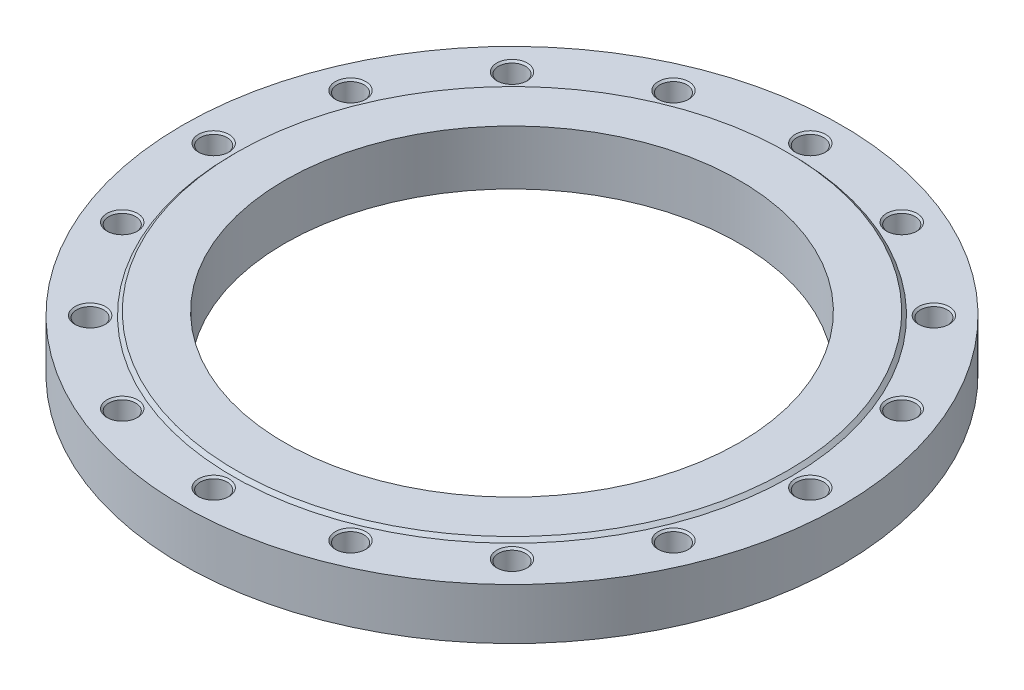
ISO-10303-21;
HEADER;
FILE_DESCRIPTION(('STEP AP214'),'2;1');
FILE_NAME('part.step','',(''),(''),'','','');
FILE_SCHEMA(('AUTOMOTIVE_DESIGN { 1 0 10303 214 1 1 1 1 }'));
ENDSEC;
DATA;
#1=APPLICATION_CONTEXT('core data for automotive mechanical design processes');
#2=APPLICATION_PROTOCOL_DEFINITION('international standard','automotive_design',2000,#1);
#3=PRODUCT_CONTEXT('',#1,'mechanical');
#4=PRODUCT('Part','Part','',(#3));
#5=PRODUCT_RELATED_PRODUCT_CATEGORY('part','',(#4));
#6=PRODUCT_DEFINITION_FORMATION('','',#4);
#7=PRODUCT_DEFINITION_CONTEXT('part definition',#1,'design');
#8=PRODUCT_DEFINITION('design','',#6,#7);
#9=PRODUCT_DEFINITION_SHAPE('','',#8);
#10=(LENGTH_UNIT() NAMED_UNIT(*) SI_UNIT(.MILLI.,.METRE.));
#11=(NAMED_UNIT(*) PLANE_ANGLE_UNIT() SI_UNIT($,.RADIAN.));
#12=(NAMED_UNIT(*) SI_UNIT($,.STERADIAN.) SOLID_ANGLE_UNIT());
#13=UNCERTAINTY_MEASURE_WITH_UNIT(LENGTH_MEASURE(1.E-05),#10,'distance_accuracy_value','');
#14=(GEOMETRIC_REPRESENTATION_CONTEXT(3) GLOBAL_UNCERTAINTY_ASSIGNED_CONTEXT((#13)) GLOBAL_UNIT_ASSIGNED_CONTEXT((#10,
#11,#12)) REPRESENTATION_CONTEXT('',''));
#15=CARTESIAN_POINT('',(0.,0.,0.));
#16=DIRECTION('',(0.,0.,1.));
#17=DIRECTION('',(1.,0.,0.));
#18=AXIS2_PLACEMENT_3D('',#15,#16,#17);
#19=CARTESIAN_POINT('',(0.,22.5,0.));
#20=DIRECTION('',(0.,-1.,0.));
#21=DIRECTION('',(1.,0.,0.));
#22=AXIS2_PLACEMENT_3D('',#19,#20,#21);
#23=CYLINDRICAL_SURFACE('',#22,290.);
#24=CARTESIAN_POINT('',(0.,0.,0.));
#25=DIRECTION('',(0.,1.,0.));
#26=DIRECTION('',(1.,0.,0.));
#27=AXIS2_PLACEMENT_3D('',#24,#25,#26);
#28=CIRCLE('',#27,290.);
#29=CARTESIAN_POINT('',(290.,0.,0.));
#30=VERTEX_POINT('',#29);
#31=EDGE_CURVE('E9',#30,#30,#28,.T.);
#32=ORIENTED_EDGE('',*,*,#31,.T.);
#33=EDGE_LOOP('',(#32));
#34=FACE_BOUND('',#33,.T.);
#35=CARTESIAN_POINT('',(0.,45.,0.));
#36=DIRECTION('',(0.,1.,0.));
#37=DIRECTION('',(1.,0.,0.));
#38=AXIS2_PLACEMENT_3D('',#35,#36,#37);
#39=CIRCLE('',#38,290.);
#40=CARTESIAN_POINT('',(290.,45.,0.));
#41=VERTEX_POINT('',#40);
#42=EDGE_CURVE('E410',#41,#41,#39,.T.);
#43=ORIENTED_EDGE('',*,*,#42,.F.);
#44=EDGE_LOOP('',(#43));
#45=FACE_BOUND('',#44,.T.);
#46=ADVANCED_FACE('F15',(#34,#45),#23,.T.);
#47=CARTESIAN_POINT('',(245.,0.,0.));
#48=DIRECTION('',(0.,-1.,0.));
#49=DIRECTION('',(-1.,0.,0.));
#50=AXIS2_PLACEMENT_3D('',#47,#48,#49);
#51=PLANE('',#50);
#52=CARTESIAN_POINT('',(0.,0.,0.));
#53=DIRECTION('',(0.,1.,0.));
#54=DIRECTION('',(1.,0.,0.));
#55=AXIS2_PLACEMENT_3D('',#52,#53,#54);
#56=CIRCLE('',#55,200.);
#57=CARTESIAN_POINT('',(200.,0.,0.));
#58=VERTEX_POINT('',#57);
#59=EDGE_CURVE('E25',#58,#58,#56,.T.);
#60=ORIENTED_EDGE('',*,*,#59,.T.);
#61=EDGE_LOOP('',(#60));
#62=FACE_BOUND('',#61,.T.);
#63=ORIENTED_EDGE('',*,*,#31,.F.);
#64=EDGE_LOOP('',(#63));
#65=FACE_BOUND('',#64,.T.);
#66=ADVANCED_FACE('F469',(#62,#65),#51,.T.);
#67=CARTESIAN_POINT('',(0.,24.,0.));
#68=DIRECTION('',(0.,-1.,0.));
#69=DIRECTION('',(1.,0.,0.));
#70=AXIS2_PLACEMENT_3D('',#67,#68,#69);
#71=CYLINDRICAL_SURFACE('',#70,200.);
#72=CARTESIAN_POINT('',(0.,48.,0.));
#73=DIRECTION('',(0.,1.,0.));
#74=DIRECTION('',(1.,0.,0.));
#75=AXIS2_PLACEMENT_3D('',#72,#73,#74);
#76=CIRCLE('',#75,200.);
#77=CARTESIAN_POINT('',(200.,48.,0.));
#78=VERTEX_POINT('',#77);
#79=EDGE_CURVE('E19',#78,#78,#76,.T.);
#80=ORIENTED_EDGE('',*,*,#79,.T.);
#81=EDGE_LOOP('',(#80));
#82=FACE_BOUND('',#81,.T.);
#83=ORIENTED_EDGE('',*,*,#59,.F.);
#84=EDGE_LOOP('',(#83));
#85=FACE_BOUND('',#84,.T.);
#86=ADVANCED_FACE('F474',(#82,#85),#71,.F.);
#87=CARTESIAN_POINT('',(221.25,48.,0.));
#88=DIRECTION('',(0.,1.,0.));
#89=DIRECTION('',(1.,0.,0.));
#90=AXIS2_PLACEMENT_3D('',#87,#88,#89);
#91=PLANE('',#90);
#92=CARTESIAN_POINT('',(0.,48.,0.));
#93=DIRECTION('',(0.,1.,0.));
#94=DIRECTION('',(1.,0.,0.));
#95=AXIS2_PLACEMENT_3D('',#92,#93,#94);
#96=CIRCLE('',#95,242.5);
#97=CARTESIAN_POINT('',(242.5,48.,0.));
#98=VERTEX_POINT('',#97);
#99=EDGE_CURVE('E411',#98,#98,#96,.T.);
#100=ORIENTED_EDGE('',*,*,#99,.T.);
#101=EDGE_LOOP('',(#100));
#102=FACE_BOUND('',#101,.T.);
#103=ORIENTED_EDGE('',*,*,#79,.F.);
#104=EDGE_LOOP('',(#103));
#105=FACE_BOUND('',#104,.T.);
#106=ADVANCED_FACE('F17',(#102,#105),#91,.T.);
#107=CARTESIAN_POINT('',(0.,46.5,0.));
#108=DIRECTION('',(0.,-1.,0.));
#109=DIRECTION('',(1.,0.,0.));
#110=AXIS2_PLACEMENT_3D('',#107,#108,#109);
#111=CONICAL_SURFACE('',#110,244.,0.78539816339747);
#112=CARTESIAN_POINT('',(0.,45.,0.));
#113=DIRECTION('',(0.,1.,0.));
#114=DIRECTION('',(1.,0.,0.));
#115=AXIS2_PLACEMENT_3D('',#112,#113,#114);
#116=CIRCLE('',#115,245.5);
#117=CARTESIAN_POINT('',(245.5,45.,0.));
#118=VERTEX_POINT('',#117);
#119=EDGE_CURVE('E77',#118,#118,#116,.T.);
#120=ORIENTED_EDGE('',*,*,#119,.T.);
#121=EDGE_LOOP('',(#120));
#122=FACE_BOUND('',#121,.T.);
#123=ORIENTED_EDGE('',*,*,#99,.F.);
#124=EDGE_LOOP('',(#123));
#125=FACE_BOUND('',#124,.T.);
#126=ADVANCED_FACE('F555',(#122,#125),#111,.T.);
#127=CARTESIAN_POINT('',(267.75,45.,0.));
#128=DIRECTION('',(0.,1.,0.));
#129=DIRECTION('',(1.,0.,0.));
#130=AXIS2_PLACEMENT_3D('',#127,#128,#129);
#131=PLANE('',#130);
#132=ORIENTED_EDGE('',*,*,#42,.T.);
#133=EDGE_LOOP('',(#132));
#134=FACE_BOUND('',#133,.T.);
#135=ORIENTED_EDGE('',*,*,#119,.F.);
#136=EDGE_LOOP('',(#135));
#137=FACE_BOUND('',#136,.T.);
#138=CARTESIAN_POINT('',(262.5,45.,0.));
#139=DIRECTION('',(0.,-1.,0.));
#140=DIRECTION('',(1.,0.,0.));
#141=AXIS2_PLACEMENT_3D('',#138,#139,#140);
#142=CIRCLE('',#141,13.5);
#143=CARTESIAN_POINT('',(276.,45.,0.));
#144=VERTEX_POINT('',#143);
#145=EDGE_CURVE('E407',#144,#144,#142,.T.);
#146=ORIENTED_EDGE('',*,*,#145,.T.);
#147=EDGE_LOOP('',(#146));
#148=FACE_BOUND('',#147,.T.);
#149=CARTESIAN_POINT('',(242.518377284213,45.,-100.454400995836));
#150=DIRECTION('',(0.,-1.,0.));
#151=DIRECTION('',(0.923879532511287,0.,-0.38268343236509));
#152=AXIS2_PLACEMENT_3D('',#149,#150,#151);
#153=CIRCLE('',#152,13.5);
#154=CARTESIAN_POINT('',(254.990750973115,45.,-105.620627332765));
#155=VERTEX_POINT('',#154);
#156=EDGE_CURVE('E390',#155,#155,#153,.T.);
#157=ORIENTED_EDGE('',*,*,#156,.T.);
#158=EDGE_LOOP('',(#157));
#159=FACE_BOUND('',#158,.T.);
#160=CARTESIAN_POINT('',(185.615530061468,45.,-185.615530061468));
#161=DIRECTION('',(0.,-1.,0.));
#162=DIRECTION('',(0.707106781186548,0.,-0.707106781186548));
#163=AXIS2_PLACEMENT_3D('',#160,#161,#162);
#164=CIRCLE('',#163,13.5);
#165=CARTESIAN_POINT('',(195.161471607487,45.,-195.161471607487));
#166=VERTEX_POINT('',#165);
#167=EDGE_CURVE('E445',#166,#166,#164,.T.);
#168=ORIENTED_EDGE('',*,*,#167,.T.);
#169=EDGE_LOOP('',(#168));
#170=FACE_BOUND('',#169,.T.);
#171=CARTESIAN_POINT('',(100.454400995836,45.,-242.518377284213));
#172=DIRECTION('',(0.,-1.,0.));
#173=DIRECTION('',(0.38268343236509,0.,-0.923879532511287));
#174=AXIS2_PLACEMENT_3D('',#171,#172,#173);
#175=CIRCLE('',#174,13.5);
#176=CARTESIAN_POINT('',(105.620627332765,45.,-254.990750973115));
#177=VERTEX_POINT('',#176);
#178=EDGE_CURVE('E437',#177,#177,#175,.T.);
#179=ORIENTED_EDGE('',*,*,#178,.T.);
#180=EDGE_LOOP('',(#179));
#181=FACE_BOUND('',#180,.T.);
#182=CARTESIAN_POINT('',(0.,45.,-262.5));
#183=DIRECTION('',(0.,-1.,0.));
#184=DIRECTION('',(0.,0.,-1.));
#185=AXIS2_PLACEMENT_3D('',#182,#183,#184);
#186=CIRCLE('',#185,13.5);
#187=CARTESIAN_POINT('',(0.,45.,-276.));
#188=VERTEX_POINT('',#187);
#189=EDGE_CURVE('E433',#188,#188,#186,.T.);
#190=ORIENTED_EDGE('',*,*,#189,.T.);
#191=EDGE_LOOP('',(#190));
#192=FACE_BOUND('',#191,.T.);
#193=CARTESIAN_POINT('',(-100.454400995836,45.,-242.518377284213));
#194=DIRECTION('',(0.,-1.,0.));
#195=DIRECTION('',(-0.38268343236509,0.,-0.923879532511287));
#196=AXIS2_PLACEMENT_3D('',#193,#194,#195);
#197=CIRCLE('',#196,13.5);
#198=CARTESIAN_POINT('',(-105.620627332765,45.,-254.990750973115));
#199=VERTEX_POINT('',#198);
#200=EDGE_CURVE('E427',#199,#199,#197,.T.);
#201=ORIENTED_EDGE('',*,*,#200,.T.);
#202=EDGE_LOOP('',(#201));
#203=FACE_BOUND('',#202,.T.);
#204=CARTESIAN_POINT('',(-185.615530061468,45.,-185.615530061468));
#205=DIRECTION('',(0.,-1.,0.));
#206=DIRECTION('',(-0.707106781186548,0.,-0.707106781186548));
#207=AXIS2_PLACEMENT_3D('',#204,#205,#206);
#208=CIRCLE('',#207,13.5);
#209=CARTESIAN_POINT('',(-195.161471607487,45.,-195.161471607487));
#210=VERTEX_POINT('',#209);
#211=EDGE_CURVE('E642',#210,#210,#208,.T.);
#212=ORIENTED_EDGE('',*,*,#211,.T.);
#213=EDGE_LOOP('',(#212));
#214=FACE_BOUND('',#213,.T.);
#215=CARTESIAN_POINT('',(-242.518377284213,45.,-100.454400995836));
#216=DIRECTION('',(0.,-1.,0.));
#217=DIRECTION('',(-0.923879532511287,0.,-0.38268343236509));
#218=AXIS2_PLACEMENT_3D('',#215,#216,#217);
#219=CIRCLE('',#218,13.5);
#220=CARTESIAN_POINT('',(-254.990750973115,45.,-105.620627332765));
#221=VERTEX_POINT('',#220);
#222=EDGE_CURVE('E633',#221,#221,#219,.T.);
#223=ORIENTED_EDGE('',*,*,#222,.T.);
#224=EDGE_LOOP('',(#223));
#225=FACE_BOUND('',#224,.T.);
#226=CARTESIAN_POINT('',(-262.5,45.,0.));
#227=DIRECTION('',(0.,-1.,0.));
#228=DIRECTION('',(-1.,0.,0.));
#229=AXIS2_PLACEMENT_3D('',#226,#227,#228);
#230=CIRCLE('',#229,13.5);
#231=CARTESIAN_POINT('',(-276.,45.,0.));
#232=VERTEX_POINT('',#231);
#233=EDGE_CURVE('E706',#232,#232,#230,.T.);
#234=ORIENTED_EDGE('',*,*,#233,.T.);
#235=EDGE_LOOP('',(#234));
#236=FACE_BOUND('',#235,.T.);
#237=CARTESIAN_POINT('',(-242.518377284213,45.,100.454400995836));
#238=DIRECTION('',(0.,-1.,0.));
#239=DIRECTION('',(-0.923879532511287,0.,0.38268343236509));
#240=AXIS2_PLACEMENT_3D('',#237,#238,#239);
#241=CIRCLE('',#240,13.5);
#242=CARTESIAN_POINT('',(-254.990750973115,45.,105.620627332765));
#243=VERTEX_POINT('',#242);
#244=EDGE_CURVE('E697',#243,#243,#241,.T.);
#245=ORIENTED_EDGE('',*,*,#244,.T.);
#246=EDGE_LOOP('',(#245));
#247=FACE_BOUND('',#246,.T.);
#248=CARTESIAN_POINT('',(-185.615530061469,45.,185.615530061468));
#249=DIRECTION('',(0.,-1.,0.));
#250=DIRECTION('',(-0.707106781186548,0.,0.707106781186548));
#251=AXIS2_PLACEMENT_3D('',#248,#249,#250);
#252=CIRCLE('',#251,13.5);
#253=CARTESIAN_POINT('',(-195.161471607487,45.,195.161471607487));
#254=VERTEX_POINT('',#253);
#255=EDGE_CURVE('E685',#254,#254,#252,.T.);
#256=ORIENTED_EDGE('',*,*,#255,.T.);
#257=EDGE_LOOP('',(#256));
#258=FACE_BOUND('',#257,.T.);
#259=CARTESIAN_POINT('',(-100.454400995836,45.,242.518377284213));
#260=DIRECTION('',(0.,-1.,0.));
#261=DIRECTION('',(-0.382683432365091,0.,0.923879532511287));
#262=AXIS2_PLACEMENT_3D('',#259,#260,#261);
#263=CIRCLE('',#262,13.5);
#264=CARTESIAN_POINT('',(-105.620627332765,45.,254.990750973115));
#265=VERTEX_POINT('',#264);
#266=EDGE_CURVE('E671',#265,#265,#263,.T.);
#267=ORIENTED_EDGE('',*,*,#266,.T.);
#268=EDGE_LOOP('',(#267));
#269=FACE_BOUND('',#268,.T.);
#270=CARTESIAN_POINT('',(0.,45.,262.5));
#271=DIRECTION('',(0.,-1.,0.));
#272=DIRECTION('',(0.,0.,1.));
#273=AXIS2_PLACEMENT_3D('',#270,#271,#272);
#274=CIRCLE('',#273,13.5);
#275=CARTESIAN_POINT('',(0.,45.,276.));
#276=VERTEX_POINT('',#275);
#277=EDGE_CURVE('E653',#276,#276,#274,.T.);
#278=ORIENTED_EDGE('',*,*,#277,.T.);
#279=EDGE_LOOP('',(#278));
#280=FACE_BOUND('',#279,.T.);
#281=CARTESIAN_POINT('',(100.454400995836,45.,242.518377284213));
#282=DIRECTION('',(0.,-1.,0.));
#283=DIRECTION('',(0.38268343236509,0.,0.923879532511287));
#284=AXIS2_PLACEMENT_3D('',#281,#282,#283);
#285=CIRCLE('',#284,13.5);
#286=CARTESIAN_POINT('',(105.620627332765,45.,254.990750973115));
#287=VERTEX_POINT('',#286);
#288=EDGE_CURVE('E741',#287,#287,#285,.T.);
#289=ORIENTED_EDGE('',*,*,#288,.T.);
#290=EDGE_LOOP('',(#289));
#291=FACE_BOUND('',#290,.T.);
#292=CARTESIAN_POINT('',(185.615530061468,45.,185.615530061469));
#293=DIRECTION('',(0.,-1.,0.));
#294=DIRECTION('',(0.707106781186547,0.,0.707106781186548));
#295=AXIS2_PLACEMENT_3D('',#292,#293,#294);
#296=CIRCLE('',#295,13.5);
#297=CARTESIAN_POINT('',(195.161471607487,45.,195.161471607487));
#298=VERTEX_POINT('',#297);
#299=EDGE_CURVE('E744',#298,#298,#296,.T.);
#300=ORIENTED_EDGE('',*,*,#299,.T.);
#301=EDGE_LOOP('',(#300));
#302=FACE_BOUND('',#301,.T.);
#303=CARTESIAN_POINT('',(242.518377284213,45.,100.454400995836));
#304=DIRECTION('',(0.,-1.,0.));
#305=DIRECTION('',(0.923879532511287,0.,0.382683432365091));
#306=AXIS2_PLACEMENT_3D('',#303,#304,#305);
#307=CIRCLE('',#306,13.5);
#308=CARTESIAN_POINT('',(254.990750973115,45.,105.620627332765));
#309=VERTEX_POINT('',#308);
#310=EDGE_CURVE('E746',#309,#309,#307,.T.);
#311=ORIENTED_EDGE('',*,*,#310,.T.);
#312=EDGE_LOOP('',(#311));
#313=FACE_BOUND('',#312,.T.);
#314=ADVANCED_FACE('F557',(#134,#137,#148,#159,#170,#181,#192,#203,#214,#225,#236,#247,#258,
#269,#280,#291,#302,#313),#131,.T.);
#315=CARTESIAN_POINT('',(262.5,5.57162193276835,0.));
#316=DIRECTION('',(0.,1.,0.));
#317=DIRECTION('',(1.,0.,0.));
#318=AXIS2_PLACEMENT_3D('',#315,#316,#317);
#319=CONICAL_SURFACE('',#318,5.938125,1.0471975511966);
#320=CARTESIAN_POINT('',(262.5,9.,0.));
#321=DIRECTION('',(0.,-1.,0.));
#322=DIRECTION('',(1.,0.,0.));
#323=AXIS2_PLACEMENT_3D('',#320,#321,#322);
#324=CIRCLE('',#323,11.87625);
#325=CARTESIAN_POINT('',(274.37625,9.,0.));
#326=VERTEX_POINT('',#325);
#327=EDGE_CURVE('E82',#326,#326,#324,.T.);
#328=ORIENTED_EDGE('',*,*,#327,.F.);
#329=EDGE_LOOP('',(#328));
#330=FACE_BOUND('',#329,.T.);
#331=CARTESIAN_POINT('',(262.5,2.1432438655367,0.));
#332=VERTEX_POINT('',#331);
#333=VERTEX_LOOP('',#332);
#334=FACE_BOUND('',#333,.T.);
#335=ADVANCED_FACE('F562',(#330,#334),#319,.F.);
#336=CARTESIAN_POINT('',(262.5,13.688125,0.));
#337=DIRECTION('',(0.,1.,0.));
#338=DIRECTION('',(1.,0.,0.));
#339=AXIS2_PLACEMENT_3D('',#336,#337,#338);
#340=CYLINDRICAL_SURFACE('',#339,11.87625);
#341=CARTESIAN_POINT('',(262.5,18.37625,0.));
#342=DIRECTION('',(0.,-1.,0.));
#343=DIRECTION('',(1.,0.,0.));
#344=AXIS2_PLACEMENT_3D('',#341,#342,#343);
#345=CIRCLE('',#344,11.87625);
#346=CARTESIAN_POINT('',(274.37625,18.37625,0.));
#347=VERTEX_POINT('',#346);
#348=EDGE_CURVE('E408',#347,#347,#345,.T.);
#349=ORIENTED_EDGE('',*,*,#348,.F.);
#350=EDGE_LOOP('',(#349));
#351=FACE_BOUND('',#350,.T.);
#352=ORIENTED_EDGE('',*,*,#327,.T.);
#353=EDGE_LOOP('',(#352));
#354=FACE_BOUND('',#353,.T.);
#355=ADVANCED_FACE('F553',(#351,#354),#340,.F.);
#356=CARTESIAN_POINT('',(262.5,19.188125,0.));
#357=DIRECTION('',(0.,1.,0.));
#358=DIRECTION('',(1.,0.,0.));
#359=AXIS2_PLACEMENT_3D('',#356,#357,#358);
#360=CONICAL_SURFACE('',#359,12.688125,0.785398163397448);
#361=CARTESIAN_POINT('',(262.5,20.,0.));
#362=DIRECTION('',(0.,-1.,0.));
#363=DIRECTION('',(1.,0.,0.));
#364=AXIS2_PLACEMENT_3D('',#361,#362,#363);
#365=CIRCLE('',#364,13.5);
#366=CARTESIAN_POINT('',(276.,20.,0.));
#367=VERTEX_POINT('',#366);
#368=EDGE_CURVE('E406',#367,#367,#365,.T.);
#369=ORIENTED_EDGE('',*,*,#368,.F.);
#370=EDGE_LOOP('',(#369));
#371=FACE_BOUND('',#370,.T.);
#372=ORIENTED_EDGE('',*,*,#348,.T.);
#373=EDGE_LOOP('',(#372));
#374=FACE_BOUND('',#373,.T.);
#375=ADVANCED_FACE('F550',(#371,#374),#360,.F.);
#376=CARTESIAN_POINT('',(275.188125,20.,0.));
#377=DIRECTION('',(0.,1.,0.));
#378=DIRECTION('',(-1.,0.,0.));
#379=AXIS2_PLACEMENT_3D('',#376,#377,#378);
#380=PLANE('',#379);
#381=CARTESIAN_POINT('',(262.5,20.,0.));
#382=DIRECTION('',(0.,-1.,0.));
#383=DIRECTION('',(1.,0.,0.));
#384=AXIS2_PLACEMENT_3D('',#381,#382,#383);
#385=CIRCLE('',#384,11.87625);
#386=CARTESIAN_POINT('',(274.37625,20.,0.));
#387=VERTEX_POINT('',#386);
#388=EDGE_CURVE('E404',#387,#387,#385,.T.);
#389=ORIENTED_EDGE('',*,*,#388,.F.);
#390=EDGE_LOOP('',(#389));
#391=FACE_BOUND('',#390,.T.);
#392=ORIENTED_EDGE('',*,*,#368,.T.);
#393=EDGE_LOOP('',(#392));
#394=FACE_BOUND('',#393,.T.);
#395=ADVANCED_FACE('F546',(#391,#394),#380,.F.);
#396=CARTESIAN_POINT('',(262.5,31.688125,0.));
#397=DIRECTION('',(0.,1.,0.));
#398=DIRECTION('',(1.,0.,0.));
#399=AXIS2_PLACEMENT_3D('',#396,#397,#398);
#400=CYLINDRICAL_SURFACE('',#399,11.87625);
#401=CARTESIAN_POINT('',(262.5,43.37625,0.));
#402=DIRECTION('',(0.,-1.,0.));
#403=DIRECTION('',(1.,0.,0.));
#404=AXIS2_PLACEMENT_3D('',#401,#402,#403);
#405=CIRCLE('',#404,11.87625);
#406=CARTESIAN_POINT('',(274.37625,43.37625,0.));
#407=VERTEX_POINT('',#406);
#408=EDGE_CURVE('E686',#407,#407,#405,.T.);
#409=ORIENTED_EDGE('',*,*,#408,.F.);
#410=EDGE_LOOP('',(#409));
#411=FACE_BOUND('',#410,.T.);
#412=ORIENTED_EDGE('',*,*,#388,.T.);
#413=EDGE_LOOP('',(#412));
#414=FACE_BOUND('',#413,.T.);
#415=ADVANCED_FACE('F542',(#411,#414),#400,.F.);
#416=CARTESIAN_POINT('',(262.5,44.188125,0.));
#417=DIRECTION('',(0.,1.,0.));
#418=DIRECTION('',(1.,0.,0.));
#419=AXIS2_PLACEMENT_3D('',#416,#417,#418);
#420=CONICAL_SURFACE('',#419,12.688125,0.785398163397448);
#421=ORIENTED_EDGE('',*,*,#145,.F.);
#422=EDGE_LOOP('',(#421));
#423=FACE_BOUND('',#422,.T.);
#424=ORIENTED_EDGE('',*,*,#408,.T.);
#425=EDGE_LOOP('',(#424));
#426=FACE_BOUND('',#425,.T.);
#427=ADVANCED_FACE('F538',(#423,#426),#420,.F.);
#428=CARTESIAN_POINT('',(242.518377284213,5.57162193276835,-100.454400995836));
#429=DIRECTION('',(0.,1.,0.));
#430=DIRECTION('',(0.923879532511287,0.,-0.38268343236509));
#431=AXIS2_PLACEMENT_3D('',#428,#429,#430);
#432=CONICAL_SURFACE('',#431,5.938125,1.0471975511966);
#433=CARTESIAN_POINT('',(242.518377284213,9.,-100.454400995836));
#434=DIRECTION('',(0.,-1.,0.));
#435=DIRECTION('',(0.923879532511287,0.,-0.38268343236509));
#436=AXIS2_PLACEMENT_3D('',#433,#434,#435);
#437=CIRCLE('',#436,11.87625);
#438=CARTESIAN_POINT('',(253.4906015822,9.,-104.999245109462));
#439=VERTEX_POINT('',#438);
#440=EDGE_CURVE('E403',#439,#439,#437,.T.);
#441=ORIENTED_EDGE('',*,*,#440,.F.);
#442=EDGE_LOOP('',(#441));
#443=FACE_BOUND('',#442,.T.);
#444=CARTESIAN_POINT('',(242.518377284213,2.1432438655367,-100.454400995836));
#445=VERTEX_POINT('',#444);
#446=VERTEX_LOOP('',#445);
#447=FACE_BOUND('',#446,.T.);
#448=ADVANCED_FACE('F534',(#443,#447),#432,.F.);
#449=CARTESIAN_POINT('',(242.518377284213,13.688125,-100.454400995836));
#450=DIRECTION('',(0.,1.,0.));
#451=DIRECTION('',(0.923879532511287,0.,-0.38268343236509));
#452=AXIS2_PLACEMENT_3D('',#449,#450,#451);
#453=CYLINDRICAL_SURFACE('',#452,11.87625);
#454=CARTESIAN_POINT('',(242.518377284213,18.37625,-100.454400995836));
#455=DIRECTION('',(0.,-1.,0.));
#456=DIRECTION('',(0.923879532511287,0.,-0.38268343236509));
#457=AXIS2_PLACEMENT_3D('',#454,#455,#456);
#458=CIRCLE('',#457,11.87625);
#459=CARTESIAN_POINT('',(253.4906015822,18.37625,-104.999245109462));
#460=VERTEX_POINT('',#459);
#461=EDGE_CURVE('E401',#460,#460,#458,.T.);
#462=ORIENTED_EDGE('',*,*,#461,.F.);
#463=EDGE_LOOP('',(#462));
#464=FACE_BOUND('',#463,.T.);
#465=ORIENTED_EDGE('',*,*,#440,.T.);
#466=EDGE_LOOP('',(#465));
#467=FACE_BOUND('',#466,.T.);
#468=ADVANCED_FACE('F530',(#464,#467),#453,.F.);
#469=CARTESIAN_POINT('',(242.518377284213,19.188125,-100.454400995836));
#470=DIRECTION('',(0.,1.,0.));
#471=DIRECTION('',(0.923879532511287,0.,-0.38268343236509));
#472=AXIS2_PLACEMENT_3D('',#469,#470,#471);
#473=CONICAL_SURFACE('',#472,12.688125,0.785398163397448);
#474=CARTESIAN_POINT('',(242.518377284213,20.,-100.454400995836));
#475=DIRECTION('',(0.,-1.,0.));
#476=DIRECTION('',(0.923879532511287,0.,-0.38268343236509));
#477=AXIS2_PLACEMENT_3D('',#474,#475,#476);
#478=CIRCLE('',#477,13.5);
#479=CARTESIAN_POINT('',(254.990750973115,20.,-105.620627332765));
#480=VERTEX_POINT('',#479);
#481=EDGE_CURVE('E400',#480,#480,#478,.T.);
#482=ORIENTED_EDGE('',*,*,#481,.F.);
#483=EDGE_LOOP('',(#482));
#484=FACE_BOUND('',#483,.T.);
#485=ORIENTED_EDGE('',*,*,#461,.T.);
#486=EDGE_LOOP('',(#485));
#487=FACE_BOUND('',#486,.T.);
#488=ADVANCED_FACE('F527',(#484,#487),#473,.F.);
#489=CARTESIAN_POINT('',(254.240676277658,20.,-105.309936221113));
#490=DIRECTION('',(0.,1.,0.));
#491=DIRECTION('',(-0.923879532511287,0.,0.38268343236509));
#492=AXIS2_PLACEMENT_3D('',#489,#490,#491);
#493=PLANE('',#492);
#494=CARTESIAN_POINT('',(242.518377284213,20.,-100.454400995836));
#495=DIRECTION('',(0.,-1.,0.));
#496=DIRECTION('',(0.923879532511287,0.,-0.38268343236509));
#497=AXIS2_PLACEMENT_3D('',#494,#495,#496);
#498=CIRCLE('',#497,11.87625);
#499=CARTESIAN_POINT('',(253.4906015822,20.,-104.999245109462));
#500=VERTEX_POINT('',#499);
#501=EDGE_CURVE('E398',#500,#500,#498,.T.);
#502=ORIENTED_EDGE('',*,*,#501,.F.);
#503=EDGE_LOOP('',(#502));
#504=FACE_BOUND('',#503,.T.);
#505=ORIENTED_EDGE('',*,*,#481,.T.);
#506=EDGE_LOOP('',(#505));
#507=FACE_BOUND('',#506,.T.);
#508=ADVANCED_FACE('F525',(#504,#507),#493,.F.);
#509=CARTESIAN_POINT('',(242.518377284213,31.688125,-100.454400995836));
#510=DIRECTION('',(0.,1.,0.));
#511=DIRECTION('',(0.923879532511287,0.,-0.38268343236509));
#512=AXIS2_PLACEMENT_3D('',#509,#510,#511);
#513=CYLINDRICAL_SURFACE('',#512,11.87625);
#514=CARTESIAN_POINT('',(242.518377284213,43.37625,-100.454400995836));
#515=DIRECTION('',(0.,-1.,0.));
#516=DIRECTION('',(0.923879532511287,0.,-0.38268343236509));
#517=AXIS2_PLACEMENT_3D('',#514,#515,#516);
#518=CIRCLE('',#517,11.87625);
#519=CARTESIAN_POINT('',(253.4906015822,43.37625,-104.999245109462));
#520=VERTEX_POINT('',#519);
#521=EDGE_CURVE('E387',#520,#520,#518,.T.);
#522=ORIENTED_EDGE('',*,*,#521,.F.);
#523=EDGE_LOOP('',(#522));
#524=FACE_BOUND('',#523,.T.);
#525=ORIENTED_EDGE('',*,*,#501,.T.);
#526=EDGE_LOOP('',(#525));
#527=FACE_BOUND('',#526,.T.);
#528=ADVANCED_FACE('F521',(#524,#527),#513,.F.);
#529=CARTESIAN_POINT('',(242.518377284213,44.188125,-100.454400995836));
#530=DIRECTION('',(0.,1.,0.));
#531=DIRECTION('',(0.923879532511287,0.,-0.38268343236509));
#532=AXIS2_PLACEMENT_3D('',#529,#530,#531);
#533=CONICAL_SURFACE('',#532,12.688125,0.785398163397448);
#534=ORIENTED_EDGE('',*,*,#156,.F.);
#535=EDGE_LOOP('',(#534));
#536=FACE_BOUND('',#535,.T.);
#537=ORIENTED_EDGE('',*,*,#521,.T.);
#538=EDGE_LOOP('',(#537));
#539=FACE_BOUND('',#538,.T.);
#540=ADVANCED_FACE('F464',(#536,#539),#533,.F.);
#541=CARTESIAN_POINT('',(185.615530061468,5.57162193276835,-185.615530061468));
#542=DIRECTION('',(0.,1.,0.));
#543=DIRECTION('',(0.707106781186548,0.,-0.707106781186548));
#544=AXIS2_PLACEMENT_3D('',#541,#542,#543);
#545=CONICAL_SURFACE('',#544,5.938125,1.0471975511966);
#546=CARTESIAN_POINT('',(185.615530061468,9.,-185.615530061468));
#547=DIRECTION('',(0.,-1.,0.));
#548=DIRECTION('',(0.707106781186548,0.,-0.707106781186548));
#549=AXIS2_PLACEMENT_3D('',#546,#547,#548);
#550=CIRCLE('',#549,11.87625);
#551=CARTESIAN_POINT('',(194.013306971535,9.,-194.013306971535));
#552=VERTEX_POINT('',#551);
#553=EDGE_CURVE('E384',#552,#552,#550,.T.);
#554=ORIENTED_EDGE('',*,*,#553,.F.);
#555=EDGE_LOOP('',(#554));
#556=FACE_BOUND('',#555,.T.);
#557=CARTESIAN_POINT('',(185.615530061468,2.1432438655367,-185.615530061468));
#558=VERTEX_POINT('',#557);
#559=VERTEX_LOOP('',#558);
#560=FACE_BOUND('',#559,.T.);
#561=ADVANCED_FACE('F458',(#556,#560),#545,.F.);
#562=CARTESIAN_POINT('',(185.615530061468,13.688125,-185.615530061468));
#563=DIRECTION('',(0.,1.,0.));
#564=DIRECTION('',(0.707106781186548,0.,-0.707106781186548));
#565=AXIS2_PLACEMENT_3D('',#562,#563,#564);
#566=CYLINDRICAL_SURFACE('',#565,11.87625);
#567=CARTESIAN_POINT('',(185.615530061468,18.37625,-185.615530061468));
#568=DIRECTION('',(0.,-1.,0.));
#569=DIRECTION('',(0.707106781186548,0.,-0.707106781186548));
#570=AXIS2_PLACEMENT_3D('',#567,#568,#569);
#571=CIRCLE('',#570,11.87625);
#572=CARTESIAN_POINT('',(194.013306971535,18.37625,-194.013306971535));
#573=VERTEX_POINT('',#572);
#574=EDGE_CURVE('E388',#573,#573,#571,.T.);
#575=ORIENTED_EDGE('',*,*,#574,.F.);
#576=EDGE_LOOP('',(#575));
#577=FACE_BOUND('',#576,.T.);
#578=ORIENTED_EDGE('',*,*,#553,.T.);
#579=EDGE_LOOP('',(#578));
#580=FACE_BOUND('',#579,.T.);
#581=ADVANCED_FACE('F385',(#577,#580),#566,.F.);
#582=CARTESIAN_POINT('',(185.615530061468,19.188125,-185.615530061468));
#583=DIRECTION('',(0.,1.,0.));
#584=DIRECTION('',(0.707106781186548,0.,-0.707106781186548));
#585=AXIS2_PLACEMENT_3D('',#582,#583,#584);
#586=CONICAL_SURFACE('',#585,12.688125,0.785398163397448);
#587=CARTESIAN_POINT('',(185.615530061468,20.,-185.615530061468));
#588=DIRECTION('',(0.,-1.,0.));
#589=DIRECTION('',(0.707106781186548,0.,-0.707106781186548));
#590=AXIS2_PLACEMENT_3D('',#587,#588,#589);
#591=CIRCLE('',#590,13.5);
#592=CARTESIAN_POINT('',(195.161471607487,20.,-195.161471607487));
#593=VERTEX_POINT('',#592);
#594=EDGE_CURVE('E392',#593,#593,#591,.T.);
#595=ORIENTED_EDGE('',*,*,#594,.F.);
#596=EDGE_LOOP('',(#595));
#597=FACE_BOUND('',#596,.T.);
#598=ORIENTED_EDGE('',*,*,#574,.T.);
#599=EDGE_LOOP('',(#598));
#600=FACE_BOUND('',#599,.T.);
#601=ADVANCED_FACE('F451',(#597,#600),#586,.F.);
#602=CARTESIAN_POINT('',(194.587389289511,20.,-194.587389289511));
#603=DIRECTION('',(0.,1.,0.));
#604=DIRECTION('',(-0.707106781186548,0.,0.707106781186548));
#605=AXIS2_PLACEMENT_3D('',#602,#603,#604);
#606=PLANE('',#605);
#607=CARTESIAN_POINT('',(185.615530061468,20.,-185.615530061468));
#608=DIRECTION('',(0.,-1.,0.));
#609=DIRECTION('',(0.707106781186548,0.,-0.707106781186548));
#610=AXIS2_PLACEMENT_3D('',#607,#608,#609);
#611=CIRCLE('',#610,11.87625);
#612=CARTESIAN_POINT('',(194.013306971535,20.,-194.013306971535));
#613=VERTEX_POINT('',#612);
#614=EDGE_CURVE('E446',#613,#613,#611,.T.);
#615=ORIENTED_EDGE('',*,*,#614,.F.);
#616=EDGE_LOOP('',(#615));
#617=FACE_BOUND('',#616,.T.);
#618=ORIENTED_EDGE('',*,*,#594,.T.);
#619=EDGE_LOOP('',(#618));
#620=FACE_BOUND('',#619,.T.);
#621=ADVANCED_FACE('F449',(#617,#620),#606,.F.);
#622=CARTESIAN_POINT('',(185.615530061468,31.688125,-185.615530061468));
#623=DIRECTION('',(0.,1.,0.));
#624=DIRECTION('',(0.707106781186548,0.,-0.707106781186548));
#625=AXIS2_PLACEMENT_3D('',#622,#623,#624);
#626=CYLINDRICAL_SURFACE('',#625,11.87625);
#627=CARTESIAN_POINT('',(185.615530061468,43.37625,-185.615530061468));
#628=DIRECTION('',(0.,-1.,0.));
#629=DIRECTION('',(0.707106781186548,0.,-0.707106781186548));
#630=AXIS2_PLACEMENT_3D('',#627,#628,#629);
#631=CIRCLE('',#630,11.87625);
#632=CARTESIAN_POINT('',(194.013306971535,43.37625,-194.013306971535));
#633=VERTEX_POINT('',#632);
#634=EDGE_CURVE('E443',#633,#633,#631,.T.);
#635=ORIENTED_EDGE('',*,*,#634,.F.);
#636=EDGE_LOOP('',(#635));
#637=FACE_BOUND('',#636,.T.);
#638=ORIENTED_EDGE('',*,*,#614,.T.);
#639=EDGE_LOOP('',(#638));
#640=FACE_BOUND('',#639,.T.);
#641=ADVANCED_FACE('F606',(#637,#640),#626,.F.);
#642=CARTESIAN_POINT('',(185.615530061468,44.188125,-185.615530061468));
#643=DIRECTION('',(0.,1.,0.));
#644=DIRECTION('',(0.707106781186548,0.,-0.707106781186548));
#645=AXIS2_PLACEMENT_3D('',#642,#643,#644);
#646=CONICAL_SURFACE('',#645,12.688125,0.785398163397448);
#647=ORIENTED_EDGE('',*,*,#167,.F.);
#648=EDGE_LOOP('',(#647));
#649=FACE_BOUND('',#648,.T.);
#650=ORIENTED_EDGE('',*,*,#634,.T.);
#651=EDGE_LOOP('',(#650));
#652=FACE_BOUND('',#651,.T.);
#653=ADVANCED_FACE('F602',(#649,#652),#646,.F.);
#654=CARTESIAN_POINT('',(100.454400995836,5.57162193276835,-242.518377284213));
#655=DIRECTION('',(0.,1.,0.));
#656=DIRECTION('',(0.38268343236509,0.,-0.923879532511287));
#657=AXIS2_PLACEMENT_3D('',#654,#655,#656);
#658=CONICAL_SURFACE('',#657,5.938125,1.0471975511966);
#659=CARTESIAN_POINT('',(100.454400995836,9.,-242.518377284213));
#660=DIRECTION('',(0.,-1.,0.));
#661=DIRECTION('',(0.38268343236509,0.,-0.923879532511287));
#662=AXIS2_PLACEMENT_3D('',#659,#660,#661);
#663=CIRCLE('',#662,11.87625);
#664=CARTESIAN_POINT('',(104.999245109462,9.,-253.4906015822));
#665=VERTEX_POINT('',#664);
#666=EDGE_CURVE('E441',#665,#665,#663,.T.);
#667=ORIENTED_EDGE('',*,*,#666,.F.);
#668=EDGE_LOOP('',(#667));
#669=FACE_BOUND('',#668,.T.);
#670=CARTESIAN_POINT('',(100.454400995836,2.1432438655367,-242.518377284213));
#671=VERTEX_POINT('',#670);
#672=VERTEX_LOOP('',#671);
#673=FACE_BOUND('',#672,.T.);
#674=ADVANCED_FACE('F605',(#669,#673),#658,.F.);
#675=CARTESIAN_POINT('',(100.454400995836,13.688125,-242.518377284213));
#676=DIRECTION('',(0.,1.,0.));
#677=DIRECTION('',(0.38268343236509,0.,-0.923879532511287));
#678=AXIS2_PLACEMENT_3D('',#675,#676,#677);
#679=CYLINDRICAL_SURFACE('',#678,11.87625);
#680=CARTESIAN_POINT('',(100.454400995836,18.37625,-242.518377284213));
#681=DIRECTION('',(0.,-1.,0.));
#682=DIRECTION('',(0.38268343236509,0.,-0.923879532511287));
#683=AXIS2_PLACEMENT_3D('',#680,#681,#682);
#684=CIRCLE('',#683,11.87625);
#685=CARTESIAN_POINT('',(104.999245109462,18.37625,-253.4906015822));
#686=VERTEX_POINT('',#685);
#687=EDGE_CURVE('E439',#686,#686,#684,.T.);
#688=ORIENTED_EDGE('',*,*,#687,.F.);
#689=EDGE_LOOP('',(#688));
#690=FACE_BOUND('',#689,.T.);
#691=ORIENTED_EDGE('',*,*,#666,.T.);
#692=EDGE_LOOP('',(#691));
#693=FACE_BOUND('',#692,.T.);
#694=ADVANCED_FACE('F919',(#690,#693),#679,.F.);
#695=CARTESIAN_POINT('',(100.454400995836,19.188125,-242.518377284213));
#696=DIRECTION('',(0.,1.,0.));
#697=DIRECTION('',(0.38268343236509,0.,-0.923879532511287));
#698=AXIS2_PLACEMENT_3D('',#695,#696,#697);
#699=CONICAL_SURFACE('',#698,12.688125,0.785398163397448);
#700=CARTESIAN_POINT('',(100.454400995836,20.,-242.518377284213));
#701=DIRECTION('',(0.,-1.,0.));
#702=DIRECTION('',(0.38268343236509,0.,-0.923879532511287));
#703=AXIS2_PLACEMENT_3D('',#700,#701,#702);
#704=CIRCLE('',#703,13.5);
#705=CARTESIAN_POINT('',(105.620627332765,20.,-254.990750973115));
#706=VERTEX_POINT('',#705);
#707=EDGE_CURVE('E442',#706,#706,#704,.T.);
#708=ORIENTED_EDGE('',*,*,#707,.F.);
#709=EDGE_LOOP('',(#708));
#710=FACE_BOUND('',#709,.T.);
#711=ORIENTED_EDGE('',*,*,#687,.T.);
#712=EDGE_LOOP('',(#711));
#713=FACE_BOUND('',#712,.T.);
#714=ADVANCED_FACE('F899',(#710,#713),#699,.F.);
#715=CARTESIAN_POINT('',(105.309936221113,20.,-254.240676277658));
#716=DIRECTION('',(0.,1.,0.));
#717=DIRECTION('',(-0.38268343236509,0.,0.923879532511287));
#718=AXIS2_PLACEMENT_3D('',#715,#716,#717);
#719=PLANE('',#718);
#720=CARTESIAN_POINT('',(100.454400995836,20.,-242.518377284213));
#721=DIRECTION('',(0.,-1.,0.));
#722=DIRECTION('',(0.38268343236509,0.,-0.923879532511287));
#723=AXIS2_PLACEMENT_3D('',#720,#721,#722);
#724=CIRCLE('',#723,11.87625);
#725=CARTESIAN_POINT('',(104.999245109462,20.,-253.4906015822));
#726=VERTEX_POINT('',#725);
#727=EDGE_CURVE('E640',#726,#726,#724,.T.);
#728=ORIENTED_EDGE('',*,*,#727,.F.);
#729=EDGE_LOOP('',(#728));
#730=FACE_BOUND('',#729,.T.);
#731=ORIENTED_EDGE('',*,*,#707,.T.);
#732=EDGE_LOOP('',(#731));
#733=FACE_BOUND('',#732,.T.);
#734=ADVANCED_FACE('F896',(#730,#733),#719,.F.);
#735=CARTESIAN_POINT('',(100.454400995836,31.688125,-242.518377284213));
#736=DIRECTION('',(0.,1.,0.));
#737=DIRECTION('',(0.38268343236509,0.,-0.923879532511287));
#738=AXIS2_PLACEMENT_3D('',#735,#736,#737);
#739=CYLINDRICAL_SURFACE('',#738,11.87625);
#740=CARTESIAN_POINT('',(100.454400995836,43.37625,-242.518377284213));
#741=DIRECTION('',(0.,-1.,0.));
#742=DIRECTION('',(0.38268343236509,0.,-0.923879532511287));
#743=AXIS2_PLACEMENT_3D('',#740,#741,#742);
#744=CIRCLE('',#743,11.87625);
#745=CARTESIAN_POINT('',(104.999245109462,43.37625,-253.4906015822));
#746=VERTEX_POINT('',#745);
#747=EDGE_CURVE('E435',#746,#746,#744,.T.);
#748=ORIENTED_EDGE('',*,*,#747,.F.);
#749=EDGE_LOOP('',(#748));
#750=FACE_BOUND('',#749,.T.);
#751=ORIENTED_EDGE('',*,*,#727,.T.);
#752=EDGE_LOOP('',(#751));
#753=FACE_BOUND('',#752,.T.);
#754=ADVANCED_FACE('F516',(#750,#753),#739,.F.);
#755=CARTESIAN_POINT('',(100.454400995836,44.188125,-242.518377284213));
#756=DIRECTION('',(0.,1.,0.));
#757=DIRECTION('',(0.38268343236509,0.,-0.923879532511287));
#758=AXIS2_PLACEMENT_3D('',#755,#756,#757);
#759=CONICAL_SURFACE('',#758,12.688125,0.785398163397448);
#760=ORIENTED_EDGE('',*,*,#178,.F.);
#761=EDGE_LOOP('',(#760));
#762=FACE_BOUND('',#761,.T.);
#763=ORIENTED_EDGE('',*,*,#747,.T.);
#764=EDGE_LOOP('',(#763));
#765=FACE_BOUND('',#764,.T.);
#766=ADVANCED_FACE('F514',(#762,#765),#759,.F.);
#767=CARTESIAN_POINT('',(0.,5.57162193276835,-262.5));
#768=DIRECTION('',(0.,1.,0.));
#769=DIRECTION('',(0.,0.,-1.));
#770=AXIS2_PLACEMENT_3D('',#767,#768,#769);
#771=CONICAL_SURFACE('',#770,5.938125,1.0471975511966);
#772=CARTESIAN_POINT('',(0.,9.,-262.5));
#773=DIRECTION('',(0.,-1.,0.));
#774=DIRECTION('',(0.,0.,-1.));
#775=AXIS2_PLACEMENT_3D('',#772,#773,#774);
#776=CIRCLE('',#775,11.87625);
#777=CARTESIAN_POINT('',(0.,9.,-274.37625));
#778=VERTEX_POINT('',#777);
#779=EDGE_CURVE('E438',#778,#778,#776,.T.);
#780=ORIENTED_EDGE('',*,*,#779,.F.);
#781=EDGE_LOOP('',(#780));
#782=FACE_BOUND('',#781,.T.);
#783=CARTESIAN_POINT('',(0.,2.1432438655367,-262.5));
#784=VERTEX_POINT('',#783);
#785=VERTEX_LOOP('',#784);
#786=FACE_BOUND('',#785,.T.);
#787=ADVANCED_FACE('F512',(#782,#786),#771,.F.);
#788=CARTESIAN_POINT('',(0.,13.688125,-262.5));
#789=DIRECTION('',(0.,1.,0.));
#790=DIRECTION('',(0.,0.,-1.));
#791=AXIS2_PLACEMENT_3D('',#788,#789,#790);
#792=CYLINDRICAL_SURFACE('',#791,11.87625);
#793=CARTESIAN_POINT('',(0.,18.37625,-262.5));
#794=DIRECTION('',(0.,-1.,0.));
#795=DIRECTION('',(0.,0.,-1.));
#796=AXIS2_PLACEMENT_3D('',#793,#794,#795);
#797=CIRCLE('',#796,11.87625);
#798=CARTESIAN_POINT('',(0.,18.37625,-274.37625));
#799=VERTEX_POINT('',#798);
#800=EDGE_CURVE('E676',#799,#799,#797,.T.);
#801=ORIENTED_EDGE('',*,*,#800,.F.);
#802=EDGE_LOOP('',(#801));
#803=FACE_BOUND('',#802,.T.);
#804=ORIENTED_EDGE('',*,*,#779,.T.);
#805=EDGE_LOOP('',(#804));
#806=FACE_BOUND('',#805,.T.);
#807=ADVANCED_FACE('F508',(#803,#806),#792,.F.);
#808=CARTESIAN_POINT('',(0.,19.188125,-262.5));
#809=DIRECTION('',(0.,1.,0.));
#810=DIRECTION('',(0.,0.,-1.));
#811=AXIS2_PLACEMENT_3D('',#808,#809,#810);
#812=CONICAL_SURFACE('',#811,12.688125,0.785398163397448);
#813=CARTESIAN_POINT('',(0.,20.,-262.5));
#814=DIRECTION('',(0.,-1.,0.));
#815=DIRECTION('',(0.,0.,-1.));
#816=AXIS2_PLACEMENT_3D('',#813,#814,#815);
#817=CIRCLE('',#816,13.5);
#818=CARTESIAN_POINT('',(0.,20.,-276.));
#819=VERTEX_POINT('',#818);
#820=EDGE_CURVE('E674',#819,#819,#817,.T.);
#821=ORIENTED_EDGE('',*,*,#820,.F.);
#822=EDGE_LOOP('',(#821));
#823=FACE_BOUND('',#822,.T.);
#824=ORIENTED_EDGE('',*,*,#800,.T.);
#825=EDGE_LOOP('',(#824));
#826=FACE_BOUND('',#825,.T.);
#827=ADVANCED_FACE('F504',(#823,#826),#812,.F.);
#828=CARTESIAN_POINT('',(0.,20.,-275.188125));
#829=DIRECTION('',(0.,1.,0.));
#830=DIRECTION('',(0.,0.,1.));
#831=AXIS2_PLACEMENT_3D('',#828,#829,#830);
#832=PLANE('',#831);
#833=CARTESIAN_POINT('',(0.,20.,-262.5));
#834=DIRECTION('',(0.,-1.,0.));
#835=DIRECTION('',(0.,0.,-1.));
#836=AXIS2_PLACEMENT_3D('',#833,#834,#835);
#837=CIRCLE('',#836,11.87625);
#838=CARTESIAN_POINT('',(0.,20.,-274.37625));
#839=VERTEX_POINT('',#838);
#840=EDGE_CURVE('E677',#839,#839,#837,.T.);
#841=ORIENTED_EDGE('',*,*,#840,.F.);
#842=EDGE_LOOP('',(#841));
#843=FACE_BOUND('',#842,.T.);
#844=ORIENTED_EDGE('',*,*,#820,.T.);
#845=EDGE_LOOP('',(#844));
#846=FACE_BOUND('',#845,.T.);
#847=ADVANCED_FACE('F507',(#843,#846),#832,.F.);
#848=CARTESIAN_POINT('',(0.,31.688125,-262.5));
#849=DIRECTION('',(0.,1.,0.));
#850=DIRECTION('',(0.,0.,-1.));
#851=AXIS2_PLACEMENT_3D('',#848,#849,#850);
#852=CYLINDRICAL_SURFACE('',#851,11.87625);
#853=CARTESIAN_POINT('',(0.,43.37625,-262.5));
#854=DIRECTION('',(0.,-1.,0.));
#855=DIRECTION('',(0.,0.,-1.));
#856=AXIS2_PLACEMENT_3D('',#853,#854,#855);
#857=CIRCLE('',#856,11.87625);
#858=CARTESIAN_POINT('',(0.,43.37625,-274.37625));
#859=VERTEX_POINT('',#858);
#860=EDGE_CURVE('E432',#859,#859,#857,.T.);
#861=ORIENTED_EDGE('',*,*,#860,.F.);
#862=EDGE_LOOP('',(#861));
#863=FACE_BOUND('',#862,.T.);
#864=ORIENTED_EDGE('',*,*,#840,.T.);
#865=EDGE_LOOP('',(#864));
#866=FACE_BOUND('',#865,.T.);
#867=ADVANCED_FACE('F588',(#863,#866),#852,.F.);
#868=CARTESIAN_POINT('',(0.,44.188125,-262.5));
#869=DIRECTION('',(0.,1.,0.));
#870=DIRECTION('',(0.,0.,-1.));
#871=AXIS2_PLACEMENT_3D('',#868,#869,#870);
#872=CONICAL_SURFACE('',#871,12.688125,0.785398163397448);
#873=ORIENTED_EDGE('',*,*,#189,.F.);
#874=EDGE_LOOP('',(#873));
#875=FACE_BOUND('',#874,.T.);
#876=ORIENTED_EDGE('',*,*,#860,.T.);
#877=EDGE_LOOP('',(#876));
#878=FACE_BOUND('',#877,.T.);
#879=ADVANCED_FACE('F502',(#875,#878),#872,.F.);
#880=CARTESIAN_POINT('',(-100.454400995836,5.57162193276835,-242.518377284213));
#881=DIRECTION('',(0.,1.,0.));
#882=DIRECTION('',(-0.38268343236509,0.,-0.923879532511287));
#883=AXIS2_PLACEMENT_3D('',#880,#881,#882);
#884=CONICAL_SURFACE('',#883,5.938125,1.0471975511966);
#885=CARTESIAN_POINT('',(-100.454400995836,9.,-242.518377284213));
#886=DIRECTION('',(0.,-1.,0.));
#887=DIRECTION('',(-0.38268343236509,0.,-0.923879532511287));
#888=AXIS2_PLACEMENT_3D('',#885,#886,#887);
#889=CIRCLE('',#888,11.87625);
#890=CARTESIAN_POINT('',(-104.999245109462,9.,-253.4906015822));
#891=VERTEX_POINT('',#890);
#892=EDGE_CURVE('E430',#891,#891,#889,.T.);
#893=ORIENTED_EDGE('',*,*,#892,.F.);
#894=EDGE_LOOP('',(#893));
#895=FACE_BOUND('',#894,.T.);
#896=CARTESIAN_POINT('',(-100.454400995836,2.1432438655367,-242.518377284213));
#897=VERTEX_POINT('',#896);
#898=VERTEX_LOOP('',#897);
#899=FACE_BOUND('',#898,.T.);
#900=ADVANCED_FACE('F498',(#895,#899),#884,.F.);
#901=CARTESIAN_POINT('',(-100.454400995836,13.688125,-242.518377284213));
#902=DIRECTION('',(0.,1.,0.));
#903=DIRECTION('',(-0.38268343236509,0.,-0.923879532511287));
#904=AXIS2_PLACEMENT_3D('',#901,#902,#903);
#905=CYLINDRICAL_SURFACE('',#904,11.87625);
#906=CARTESIAN_POINT('',(-100.454400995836,18.37625,-242.518377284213));
#907=DIRECTION('',(0.,-1.,0.));
#908=DIRECTION('',(-0.38268343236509,0.,-0.923879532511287));
#909=AXIS2_PLACEMENT_3D('',#906,#907,#908);
#910=CIRCLE('',#909,11.87625);
#911=CARTESIAN_POINT('',(-104.999245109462,18.37625,-253.4906015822));
#912=VERTEX_POINT('',#911);
#913=EDGE_CURVE('E428',#912,#912,#910,.T.);
#914=ORIENTED_EDGE('',*,*,#913,.F.);
#915=EDGE_LOOP('',(#914));
#916=FACE_BOUND('',#915,.T.);
#917=ORIENTED_EDGE('',*,*,#892,.T.);
#918=EDGE_LOOP('',(#917));
#919=FACE_BOUND('',#918,.T.);
#920=ADVANCED_FACE('F495',(#916,#919),#905,.F.);
#921=CARTESIAN_POINT('',(-100.454400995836,19.188125,-242.518377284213));
#922=DIRECTION('',(0.,1.,0.));
#923=DIRECTION('',(-0.38268343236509,0.,-0.923879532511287));
#924=AXIS2_PLACEMENT_3D('',#921,#922,#923);
#925=CONICAL_SURFACE('',#924,12.688125,0.785398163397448);
#926=CARTESIAN_POINT('',(-100.454400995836,20.,-242.518377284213));
#927=DIRECTION('',(0.,-1.,0.));
#928=DIRECTION('',(-0.38268343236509,0.,-0.923879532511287));
#929=AXIS2_PLACEMENT_3D('',#926,#927,#928);
#930=CIRCLE('',#929,13.5);
#931=CARTESIAN_POINT('',(-105.620627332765,20.,-254.990750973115));
#932=VERTEX_POINT('',#931);
#933=EDGE_CURVE('E426',#932,#932,#930,.T.);
#934=ORIENTED_EDGE('',*,*,#933,.F.);
#935=EDGE_LOOP('',(#934));
#936=FACE_BOUND('',#935,.T.);
#937=ORIENTED_EDGE('',*,*,#913,.T.);
#938=EDGE_LOOP('',(#937));
#939=FACE_BOUND('',#938,.T.);
#940=ADVANCED_FACE('F493',(#936,#939),#925,.F.);
#941=CARTESIAN_POINT('',(-105.309936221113,20.,-254.240676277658));
#942=DIRECTION('',(0.,1.,0.));
#943=DIRECTION('',(0.38268343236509,0.,0.923879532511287));
#944=AXIS2_PLACEMENT_3D('',#941,#942,#943);
#945=PLANE('',#944);
#946=CARTESIAN_POINT('',(-100.454400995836,20.,-242.518377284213));
#947=DIRECTION('',(0.,-1.,0.));
#948=DIRECTION('',(-0.38268343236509,0.,-0.923879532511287));
#949=AXIS2_PLACEMENT_3D('',#946,#947,#948);
#950=CIRCLE('',#949,11.87625);
#951=CARTESIAN_POINT('',(-104.999245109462,20.,-253.4906015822));
#952=VERTEX_POINT('',#951);
#953=EDGE_CURVE('E424',#952,#952,#950,.T.);
#954=ORIENTED_EDGE('',*,*,#953,.F.);
#955=EDGE_LOOP('',(#954));
#956=FACE_BOUND('',#955,.T.);
#957=ORIENTED_EDGE('',*,*,#933,.T.);
#958=EDGE_LOOP('',(#957));
#959=FACE_BOUND('',#958,.T.);
#960=ADVANCED_FACE('F489',(#956,#959),#945,.F.);
#961=CARTESIAN_POINT('',(-100.454400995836,31.688125,-242.518377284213));
#962=DIRECTION('',(0.,1.,0.));
#963=DIRECTION('',(-0.38268343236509,0.,-0.923879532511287));
#964=AXIS2_PLACEMENT_3D('',#961,#962,#963);
#965=CYLINDRICAL_SURFACE('',#964,11.87625);
#966=CARTESIAN_POINT('',(-100.454400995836,43.37625,-242.518377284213));
#967=DIRECTION('',(0.,-1.,0.));
#968=DIRECTION('',(-0.38268343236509,0.,-0.923879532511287));
#969=AXIS2_PLACEMENT_3D('',#966,#967,#968);
#970=CIRCLE('',#969,11.87625);
#971=CARTESIAN_POINT('',(-104.999245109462,43.37625,-253.4906015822));
#972=VERTEX_POINT('',#971);
#973=EDGE_CURVE('E423',#972,#972,#970,.T.);
#974=ORIENTED_EDGE('',*,*,#973,.F.);
#975=EDGE_LOOP('',(#974));
#976=FACE_BOUND('',#975,.T.);
#977=ORIENTED_EDGE('',*,*,#953,.T.);
#978=EDGE_LOOP('',(#977));
#979=FACE_BOUND('',#978,.T.);
#980=ADVANCED_FACE('F485',(#976,#979),#965,.F.);
#981=CARTESIAN_POINT('',(-100.454400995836,44.188125,-242.518377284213));
#982=DIRECTION('',(0.,1.,0.));
#983=DIRECTION('',(-0.38268343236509,0.,-0.923879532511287));
#984=AXIS2_PLACEMENT_3D('',#981,#982,#983);
#985=CONICAL_SURFACE('',#984,12.688125,0.785398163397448);
#986=ORIENTED_EDGE('',*,*,#200,.F.);
#987=EDGE_LOOP('',(#986));
#988=FACE_BOUND('',#987,.T.);
#989=ORIENTED_EDGE('',*,*,#973,.T.);
#990=EDGE_LOOP('',(#989));
#991=FACE_BOUND('',#990,.T.);
#992=ADVANCED_FACE('F482',(#988,#991),#985,.F.);
#993=CARTESIAN_POINT('',(-185.615530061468,5.57162193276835,-185.615530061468));
#994=DIRECTION('',(0.,1.,0.));
#995=DIRECTION('',(-0.707106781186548,0.,-0.707106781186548));
#996=AXIS2_PLACEMENT_3D('',#993,#994,#995);
#997=CONICAL_SURFACE('',#996,5.938125,1.0471975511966);
#998=CARTESIAN_POINT('',(-185.615530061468,9.,-185.615530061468));
#999=DIRECTION('',(0.,-1.,0.));
#1000=DIRECTION('',(-0.707106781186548,0.,-0.707106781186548));
#1001=AXIS2_PLACEMENT_3D('',#998,#999,#1000);
#1002=CIRCLE('',#1001,11.87625);
#1003=CARTESIAN_POINT('',(-194.013306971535,9.,-194.013306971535));
#1004=VERTEX_POINT('',#1003);
#1005=EDGE_CURVE('E421',#1004,#1004,#1002,.T.);
#1006=ORIENTED_EDGE('',*,*,#1005,.F.);
#1007=EDGE_LOOP('',(#1006));
#1008=FACE_BOUND('',#1007,.T.);
#1009=CARTESIAN_POINT('',(-185.615530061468,2.1432438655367,-185.615530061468));
#1010=VERTEX_POINT('',#1009);
#1011=VERTEX_LOOP('',#1010);
#1012=FACE_BOUND('',#1011,.T.);
#1013=ADVANCED_FACE('F480',(#1008,#1012),#997,.F.);
#1014=CARTESIAN_POINT('',(-185.615530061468,13.688125,-185.615530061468));
#1015=DIRECTION('',(0.,1.,0.));
#1016=DIRECTION('',(-0.707106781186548,0.,-0.707106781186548));
#1017=AXIS2_PLACEMENT_3D('',#1014,#1015,#1016);
#1018=CYLINDRICAL_SURFACE('',#1017,11.87625);
#1019=CARTESIAN_POINT('',(-185.615530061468,18.37625,-185.615530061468));
#1020=DIRECTION('',(0.,-1.,0.));
#1021=DIRECTION('',(-0.707106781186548,0.,-0.707106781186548));
#1022=AXIS2_PLACEMENT_3D('',#1019,#1020,#1021);
#1023=CIRCLE('',#1022,11.87625);
#1024=CARTESIAN_POINT('',(-194.013306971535,18.37625,-194.013306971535));
#1025=VERTEX_POINT('',#1024);
#1026=EDGE_CURVE('E419',#1025,#1025,#1023,.T.);
#1027=ORIENTED_EDGE('',*,*,#1026,.F.);
#1028=EDGE_LOOP('',(#1027));
#1029=FACE_BOUND('',#1028,.T.);
#1030=ORIENTED_EDGE('',*,*,#1005,.T.);
#1031=EDGE_LOOP('',(#1030));
#1032=FACE_BOUND('',#1031,.T.);
#1033=ADVANCED_FACE('F1358',(#1029,#1032),#1018,.F.);
#1034=CARTESIAN_POINT('',(-185.615530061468,19.188125,-185.615530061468));
#1035=DIRECTION('',(0.,1.,0.));
#1036=DIRECTION('',(-0.707106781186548,0.,-0.707106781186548));
#1037=AXIS2_PLACEMENT_3D('',#1034,#1035,#1036);
#1038=CONICAL_SURFACE('',#1037,12.688125,0.785398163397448);
#1039=CARTESIAN_POINT('',(-185.615530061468,20.,-185.615530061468));
#1040=DIRECTION('',(0.,-1.,0.));
#1041=DIRECTION('',(-0.707106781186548,0.,-0.707106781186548));
#1042=AXIS2_PLACEMENT_3D('',#1039,#1040,#1041);
#1043=CIRCLE('',#1042,13.5);
#1044=CARTESIAN_POINT('',(-195.161471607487,20.,-195.161471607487));
#1045=VERTEX_POINT('',#1044);
#1046=EDGE_CURVE('E644',#1045,#1045,#1043,.T.);
#1047=ORIENTED_EDGE('',*,*,#1046,.F.);
#1048=EDGE_LOOP('',(#1047));
#1049=FACE_BOUND('',#1048,.T.);
#1050=ORIENTED_EDGE('',*,*,#1026,.T.);
#1051=EDGE_LOOP('',(#1050));
#1052=FACE_BOUND('',#1051,.T.);
#1053=ADVANCED_FACE('F1367',(#1049,#1052),#1038,.F.);
#1054=CARTESIAN_POINT('',(-194.587389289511,20.,-194.587389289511));
#1055=DIRECTION('',(0.,1.,0.));
#1056=DIRECTION('',(0.707106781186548,0.,0.707106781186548));
#1057=AXIS2_PLACEMENT_3D('',#1054,#1055,#1056);
#1058=PLANE('',#1057);
#1059=CARTESIAN_POINT('',(-185.615530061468,20.,-185.615530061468));
#1060=DIRECTION('',(0.,-1.,0.));
#1061=DIRECTION('',(-0.707106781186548,0.,-0.707106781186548));
#1062=AXIS2_PLACEMENT_3D('',#1059,#1060,#1061);
#1063=CIRCLE('',#1062,11.87625);
#1064=CARTESIAN_POINT('',(-194.013306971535,20.,-194.013306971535));
#1065=VERTEX_POINT('',#1064);
#1066=EDGE_CURVE('E643',#1065,#1065,#1063,.T.);
#1067=ORIENTED_EDGE('',*,*,#1066,.F.);
#1068=EDGE_LOOP('',(#1067));
#1069=FACE_BOUND('',#1068,.T.);
#1070=ORIENTED_EDGE('',*,*,#1046,.T.);
#1071=EDGE_LOOP('',(#1070));
#1072=FACE_BOUND('',#1071,.T.);
#1073=ADVANCED_FACE('F1376',(#1069,#1072),#1058,.F.);
#1074=CARTESIAN_POINT('',(-185.615530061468,31.688125,-185.615530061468));
#1075=DIRECTION('',(0.,1.,0.));
#1076=DIRECTION('',(-0.707106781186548,0.,-0.707106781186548));
#1077=AXIS2_PLACEMENT_3D('',#1074,#1075,#1076);
#1078=CYLINDRICAL_SURFACE('',#1077,11.87625);
#1079=CARTESIAN_POINT('',(-185.615530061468,43.37625,-185.615530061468));
#1080=DIRECTION('',(0.,-1.,0.));
#1081=DIRECTION('',(-0.707106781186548,0.,-0.707106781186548));
#1082=AXIS2_PLACEMENT_3D('',#1079,#1080,#1081);
#1083=CIRCLE('',#1082,11.87625);
#1084=CARTESIAN_POINT('',(-194.013306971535,43.37625,-194.013306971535));
#1085=VERTEX_POINT('',#1084);
#1086=EDGE_CURVE('E638',#1085,#1085,#1083,.T.);
#1087=ORIENTED_EDGE('',*,*,#1086,.F.);
#1088=EDGE_LOOP('',(#1087));
#1089=FACE_BOUND('',#1088,.T.);
#1090=ORIENTED_EDGE('',*,*,#1066,.T.);
#1091=EDGE_LOOP('',(#1090));
#1092=FACE_BOUND('',#1091,.T.);
#1093=ADVANCED_FACE('F1386',(#1089,#1092),#1078,.F.);
#1094=CARTESIAN_POINT('',(-185.615530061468,44.188125,-185.615530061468));
#1095=DIRECTION('',(0.,1.,0.));
#1096=DIRECTION('',(-0.707106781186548,0.,-0.707106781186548));
#1097=AXIS2_PLACEMENT_3D('',#1094,#1095,#1096);
#1098=CONICAL_SURFACE('',#1097,12.688125,0.785398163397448);
#1099=ORIENTED_EDGE('',*,*,#211,.F.);
#1100=EDGE_LOOP('',(#1099));
#1101=FACE_BOUND('',#1100,.T.);
#1102=ORIENTED_EDGE('',*,*,#1086,.T.);
#1103=EDGE_LOOP('',(#1102));
#1104=FACE_BOUND('',#1103,.T.);
#1105=ADVANCED_FACE('F1396',(#1101,#1104),#1098,.F.);
#1106=CARTESIAN_POINT('',(-242.518377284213,5.57162193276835,-100.454400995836));
#1107=DIRECTION('',(0.,1.,0.));
#1108=DIRECTION('',(-0.923879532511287,0.,-0.38268343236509));
#1109=AXIS2_PLACEMENT_3D('',#1106,#1107,#1108);
#1110=CONICAL_SURFACE('',#1109,5.938125,1.0471975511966);
#1111=CARTESIAN_POINT('',(-242.518377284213,9.,-100.454400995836));
#1112=DIRECTION('',(0.,-1.,0.));
#1113=DIRECTION('',(-0.923879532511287,0.,-0.38268343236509));
#1114=AXIS2_PLACEMENT_3D('',#1111,#1112,#1113);
#1115=CIRCLE('',#1114,11.87625);
#1116=CARTESIAN_POINT('',(-253.4906015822,9.,-104.999245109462));
#1117=VERTEX_POINT('',#1116);
#1118=EDGE_CURVE('E631',#1117,#1117,#1115,.T.);
#1119=ORIENTED_EDGE('',*,*,#1118,.F.);
#1120=EDGE_LOOP('',(#1119));
#1121=FACE_BOUND('',#1120,.T.);
#1122=CARTESIAN_POINT('',(-242.518377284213,2.1432438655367,-100.454400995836));
#1123=VERTEX_POINT('',#1122);
#1124=VERTEX_LOOP('',#1123);
#1125=FACE_BOUND('',#1124,.T.);
#1126=ADVANCED_FACE('F1406',(#1121,#1125),#1110,.F.);
#1127=CARTESIAN_POINT('',(-242.518377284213,13.688125,-100.454400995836));
#1128=DIRECTION('',(0.,1.,0.));
#1129=DIRECTION('',(-0.923879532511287,0.,-0.38268343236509));
#1130=AXIS2_PLACEMENT_3D('',#1127,#1128,#1129);
#1131=CYLINDRICAL_SURFACE('',#1130,11.87625);
#1132=CARTESIAN_POINT('',(-242.518377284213,18.37625,-100.454400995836));
#1133=DIRECTION('',(0.,-1.,0.));
#1134=DIRECTION('',(-0.923879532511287,0.,-0.38268343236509));
#1135=AXIS2_PLACEMENT_3D('',#1132,#1133,#1134);
#1136=CIRCLE('',#1135,11.87625);
#1137=CARTESIAN_POINT('',(-253.4906015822,18.37625,-104.999245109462));
#1138=VERTEX_POINT('',#1137);
#1139=EDGE_CURVE('E629',#1138,#1138,#1136,.T.);
#1140=ORIENTED_EDGE('',*,*,#1139,.F.);
#1141=EDGE_LOOP('',(#1140));
#1142=FACE_BOUND('',#1141,.T.);
#1143=ORIENTED_EDGE('',*,*,#1118,.T.);
#1144=EDGE_LOOP('',(#1143));
#1145=FACE_BOUND('',#1144,.T.);
#1146=ADVANCED_FACE('F621',(#1142,#1145),#1131,.F.);
#1147=CARTESIAN_POINT('',(-242.518377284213,19.188125,-100.454400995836));
#1148=DIRECTION('',(0.,1.,0.));
#1149=DIRECTION('',(-0.923879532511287,0.,-0.38268343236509));
#1150=AXIS2_PLACEMENT_3D('',#1147,#1148,#1149);
#1151=CONICAL_SURFACE('',#1150,12.688125,0.785398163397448);
#1152=CARTESIAN_POINT('',(-242.518377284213,20.,-100.454400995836));
#1153=DIRECTION('',(0.,-1.,0.));
#1154=DIRECTION('',(-0.923879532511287,0.,-0.38268343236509));
#1155=AXIS2_PLACEMENT_3D('',#1152,#1153,#1154);
#1156=CIRCLE('',#1155,13.5);
#1157=CARTESIAN_POINT('',(-254.990750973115,20.,-105.620627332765));
#1158=VERTEX_POINT('',#1157);
#1159=EDGE_CURVE('E628',#1158,#1158,#1156,.T.);
#1160=ORIENTED_EDGE('',*,*,#1159,.F.);
#1161=EDGE_LOOP('',(#1160));
#1162=FACE_BOUND('',#1161,.T.);
#1163=ORIENTED_EDGE('',*,*,#1139,.T.);
#1164=EDGE_LOOP('',(#1163));
#1165=FACE_BOUND('',#1164,.T.);
#1166=ADVANCED_FACE('F616',(#1162,#1165),#1151,.F.);
#1167=CARTESIAN_POINT('',(-254.240676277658,20.,-105.309936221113));
#1168=DIRECTION('',(0.,1.,0.));
#1169=DIRECTION('',(0.923879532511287,0.,0.38268343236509));
#1170=AXIS2_PLACEMENT_3D('',#1167,#1168,#1169);
#1171=PLANE('',#1170);
#1172=CARTESIAN_POINT('',(-242.518377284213,20.,-100.454400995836));
#1173=DIRECTION('',(0.,-1.,0.));
#1174=DIRECTION('',(-0.923879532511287,0.,-0.38268343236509));
#1175=AXIS2_PLACEMENT_3D('',#1172,#1173,#1174);
#1176=CIRCLE('',#1175,11.87625);
#1177=CARTESIAN_POINT('',(-253.4906015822,20.,-104.999245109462));
#1178=VERTEX_POINT('',#1177);
#1179=EDGE_CURVE('E626',#1178,#1178,#1176,.T.);
#1180=ORIENTED_EDGE('',*,*,#1179,.F.);
#1181=EDGE_LOOP('',(#1180));
#1182=FACE_BOUND('',#1181,.T.);
#1183=ORIENTED_EDGE('',*,*,#1159,.T.);
#1184=EDGE_LOOP('',(#1183));
#1185=FACE_BOUND('',#1184,.T.);
#1186=ADVANCED_FACE('F613',(#1182,#1185),#1171,.F.);
#1187=CARTESIAN_POINT('',(-242.518377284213,31.688125,-100.454400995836));
#1188=DIRECTION('',(0.,1.,0.));
#1189=DIRECTION('',(-0.923879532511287,0.,-0.38268343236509));
#1190=AXIS2_PLACEMENT_3D('',#1187,#1188,#1189);
#1191=CYLINDRICAL_SURFACE('',#1190,11.87625);
#1192=CARTESIAN_POINT('',(-242.518377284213,43.37625,-100.454400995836));
#1193=DIRECTION('',(0.,-1.,0.));
#1194=DIRECTION('',(-0.923879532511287,0.,-0.38268343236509));
#1195=AXIS2_PLACEMENT_3D('',#1192,#1193,#1194);
#1196=CIRCLE('',#1195,11.87625);
#1197=CARTESIAN_POINT('',(-253.4906015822,43.37625,-104.999245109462));
#1198=VERTEX_POINT('',#1197);
#1199=EDGE_CURVE('E721',#1198,#1198,#1196,.T.);
#1200=ORIENTED_EDGE('',*,*,#1199,.F.);
#1201=EDGE_LOOP('',(#1200));
#1202=FACE_BOUND('',#1201,.T.);
#1203=ORIENTED_EDGE('',*,*,#1179,.T.);
#1204=EDGE_LOOP('',(#1203));
#1205=FACE_BOUND('',#1204,.T.);
#1206=ADVANCED_FACE('F610',(#1202,#1205),#1191,.F.);
#1207=CARTESIAN_POINT('',(-242.518377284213,44.188125,-100.454400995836));
#1208=DIRECTION('',(0.,1.,0.));
#1209=DIRECTION('',(-0.923879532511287,0.,-0.38268343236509));
#1210=AXIS2_PLACEMENT_3D('',#1207,#1208,#1209);
#1211=CONICAL_SURFACE('',#1210,12.688125,0.785398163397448);
#1212=ORIENTED_EDGE('',*,*,#222,.F.);
#1213=EDGE_LOOP('',(#1212));
#1214=FACE_BOUND('',#1213,.T.);
#1215=ORIENTED_EDGE('',*,*,#1199,.T.);
#1216=EDGE_LOOP('',(#1215));
#1217=FACE_BOUND('',#1216,.T.);
#1218=ADVANCED_FACE('F600',(#1214,#1217),#1211,.F.);
#1219=CARTESIAN_POINT('',(-262.5,5.57162193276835,0.));
#1220=DIRECTION('',(0.,1.,0.));
#1221=DIRECTION('',(-1.,0.,0.));
#1222=AXIS2_PLACEMENT_3D('',#1219,#1220,#1221);
#1223=CONICAL_SURFACE('',#1222,5.938125,1.0471975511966);
#1224=CARTESIAN_POINT('',(-262.5,9.,0.));
#1225=DIRECTION('',(0.,-1.,0.));
#1226=DIRECTION('',(-1.,0.,0.));
#1227=AXIS2_PLACEMENT_3D('',#1224,#1225,#1226);
#1228=CIRCLE('',#1227,11.87625);
#1229=CARTESIAN_POINT('',(-274.37625,9.,0.));
#1230=VERTEX_POINT('',#1229);
#1231=EDGE_CURVE('E718',#1230,#1230,#1228,.T.);
#1232=ORIENTED_EDGE('',*,*,#1231,.F.);
#1233=EDGE_LOOP('',(#1232));
#1234=FACE_BOUND('',#1233,.T.);
#1235=CARTESIAN_POINT('',(-262.5,2.1432438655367,0.));
#1236=VERTEX_POINT('',#1235);
#1237=VERTEX_LOOP('',#1236);
#1238=FACE_BOUND('',#1237,.T.);
#1239=ADVANCED_FACE('F596',(#1234,#1238),#1223,.F.);
#1240=CARTESIAN_POINT('',(-262.5,13.688125,0.));
#1241=DIRECTION('',(0.,1.,0.));
#1242=DIRECTION('',(-1.,0.,0.));
#1243=AXIS2_PLACEMENT_3D('',#1240,#1241,#1242);
#1244=CYLINDRICAL_SURFACE('',#1243,11.87625);
#1245=CARTESIAN_POINT('',(-262.5,18.37625,0.));
#1246=DIRECTION('',(0.,-1.,0.));
#1247=DIRECTION('',(-1.,0.,0.));
#1248=AXIS2_PLACEMENT_3D('',#1245,#1246,#1247);
#1249=CIRCLE('',#1248,11.87625);
#1250=CARTESIAN_POINT('',(-274.37625,18.37625,0.));
#1251=VERTEX_POINT('',#1250);
#1252=EDGE_CURVE('E715',#1251,#1251,#1249,.T.);
#1253=ORIENTED_EDGE('',*,*,#1252,.F.);
#1254=EDGE_LOOP('',(#1253));
#1255=FACE_BOUND('',#1254,.T.);
#1256=ORIENTED_EDGE('',*,*,#1231,.T.);
#1257=EDGE_LOOP('',(#1256));
#1258=FACE_BOUND('',#1257,.T.);
#1259=ADVANCED_FACE('F592',(#1255,#1258),#1244,.F.);
#1260=CARTESIAN_POINT('',(-262.5,19.188125,0.));
#1261=DIRECTION('',(0.,1.,0.));
#1262=DIRECTION('',(-1.,0.,0.));
#1263=AXIS2_PLACEMENT_3D('',#1260,#1261,#1262);
#1264=CONICAL_SURFACE('',#1263,12.688125,0.785398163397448);
#1265=CARTESIAN_POINT('',(-262.5,20.,0.));
#1266=DIRECTION('',(0.,-1.,0.));
#1267=DIRECTION('',(-1.,0.,0.));
#1268=AXIS2_PLACEMENT_3D('',#1265,#1266,#1267);
#1269=CIRCLE('',#1268,13.5);
#1270=CARTESIAN_POINT('',(-276.,20.,0.));
#1271=VERTEX_POINT('',#1270);
#1272=EDGE_CURVE('E712',#1271,#1271,#1269,.T.);
#1273=ORIENTED_EDGE('',*,*,#1272,.F.);
#1274=EDGE_LOOP('',(#1273));
#1275=FACE_BOUND('',#1274,.T.);
#1276=ORIENTED_EDGE('',*,*,#1252,.T.);
#1277=EDGE_LOOP('',(#1276));
#1278=FACE_BOUND('',#1277,.T.);
#1279=ADVANCED_FACE('F584',(#1275,#1278),#1264,.F.);
#1280=CARTESIAN_POINT('',(-275.188125,20.,0.));
#1281=DIRECTION('',(0.,1.,0.));
#1282=DIRECTION('',(1.,0.,0.));
#1283=AXIS2_PLACEMENT_3D('',#1280,#1281,#1282);
#1284=PLANE('',#1283);
#1285=CARTESIAN_POINT('',(-262.5,20.,0.));
#1286=DIRECTION('',(0.,-1.,0.));
#1287=DIRECTION('',(-1.,0.,0.));
#1288=AXIS2_PLACEMENT_3D('',#1285,#1286,#1287);
#1289=CIRCLE('',#1288,11.87625);
#1290=CARTESIAN_POINT('',(-274.37625,20.,0.));
#1291=VERTEX_POINT('',#1290);
#1292=EDGE_CURVE('E709',#1291,#1291,#1289,.T.);
#1293=ORIENTED_EDGE('',*,*,#1292,.F.);
#1294=EDGE_LOOP('',(#1293));
#1295=FACE_BOUND('',#1294,.T.);
#1296=ORIENTED_EDGE('',*,*,#1272,.T.);
#1297=EDGE_LOOP('',(#1296));
#1298=FACE_BOUND('',#1297,.T.);
#1299=ADVANCED_FACE('F581',(#1295,#1298),#1284,.F.);
#1300=CARTESIAN_POINT('',(-262.5,31.688125,0.));
#1301=DIRECTION('',(0.,1.,0.));
#1302=DIRECTION('',(-1.,0.,0.));
#1303=AXIS2_PLACEMENT_3D('',#1300,#1301,#1302);
#1304=CYLINDRICAL_SURFACE('',#1303,11.87625);
#1305=CARTESIAN_POINT('',(-262.5,43.37625,0.));
#1306=DIRECTION('',(0.,-1.,0.));
#1307=DIRECTION('',(-1.,0.,0.));
#1308=AXIS2_PLACEMENT_3D('',#1305,#1306,#1307);
#1309=CIRCLE('',#1308,11.87625);
#1310=CARTESIAN_POINT('',(-274.37625,43.37625,0.));
#1311=VERTEX_POINT('',#1310);
#1312=EDGE_CURVE('E666',#1311,#1311,#1309,.T.);
#1313=ORIENTED_EDGE('',*,*,#1312,.F.);
#1314=EDGE_LOOP('',(#1313));
#1315=FACE_BOUND('',#1314,.T.);
#1316=ORIENTED_EDGE('',*,*,#1292,.T.);
#1317=EDGE_LOOP('',(#1316));
#1318=FACE_BOUND('',#1317,.T.);
#1319=ADVANCED_FACE('F579',(#1315,#1318),#1304,.F.);
#1320=CARTESIAN_POINT('',(-262.5,44.188125,0.));
#1321=DIRECTION('',(0.,1.,0.));
#1322=DIRECTION('',(-1.,0.,0.));
#1323=AXIS2_PLACEMENT_3D('',#1320,#1321,#1322);
#1324=CONICAL_SURFACE('',#1323,12.688125,0.785398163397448);
#1325=ORIENTED_EDGE('',*,*,#233,.F.);
#1326=EDGE_LOOP('',(#1325));
#1327=FACE_BOUND('',#1326,.T.);
#1328=ORIENTED_EDGE('',*,*,#1312,.T.);
#1329=EDGE_LOOP('',(#1328));
#1330=FACE_BOUND('',#1329,.T.);
#1331=ADVANCED_FACE('F903',(#1327,#1330),#1324,.F.);
#1332=CARTESIAN_POINT('',(-242.518377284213,5.57162193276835,100.454400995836));
#1333=DIRECTION('',(0.,1.,0.));
#1334=DIRECTION('',(-0.923879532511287,0.,0.38268343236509));
#1335=AXIS2_PLACEMENT_3D('',#1332,#1333,#1334);
#1336=CONICAL_SURFACE('',#1335,5.938125,1.0471975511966);
#1337=CARTESIAN_POINT('',(-242.518377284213,9.,100.454400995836));
#1338=DIRECTION('',(0.,-1.,0.));
#1339=DIRECTION('',(-0.923879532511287,0.,0.38268343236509));
#1340=AXIS2_PLACEMENT_3D('',#1337,#1338,#1339);
#1341=CIRCLE('',#1340,11.87625);
#1342=CARTESIAN_POINT('',(-253.4906015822,9.,104.999245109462));
#1343=VERTEX_POINT('',#1342);
#1344=EDGE_CURVE('E664',#1343,#1343,#1341,.T.);
#1345=ORIENTED_EDGE('',*,*,#1344,.F.);
#1346=EDGE_LOOP('',(#1345));
#1347=FACE_BOUND('',#1346,.T.);
#1348=CARTESIAN_POINT('',(-242.518377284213,2.1432438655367,100.454400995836));
#1349=VERTEX_POINT('',#1348);
#1350=VERTEX_LOOP('',#1349);
#1351=FACE_BOUND('',#1350,.T.);
#1352=ADVANCED_FACE('F894',(#1347,#1351),#1336,.F.);
#1353=CARTESIAN_POINT('',(-242.518377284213,13.688125,100.454400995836));
#1354=DIRECTION('',(0.,1.,0.));
#1355=DIRECTION('',(-0.923879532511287,0.,0.38268343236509));
#1356=AXIS2_PLACEMENT_3D('',#1353,#1354,#1355);
#1357=CYLINDRICAL_SURFACE('',#1356,11.87625);
#1358=CARTESIAN_POINT('',(-242.518377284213,18.37625,100.454400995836));
#1359=DIRECTION('',(0.,-1.,0.));
#1360=DIRECTION('',(-0.923879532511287,0.,0.38268343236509));
#1361=AXIS2_PLACEMENT_3D('',#1358,#1359,#1360);
#1362=CIRCLE('',#1361,11.87625);
#1363=CARTESIAN_POINT('',(-253.4906015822,18.37625,104.999245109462));
#1364=VERTEX_POINT('',#1363);
#1365=EDGE_CURVE('E667',#1364,#1364,#1362,.T.);
#1366=ORIENTED_EDGE('',*,*,#1365,.F.);
#1367=EDGE_LOOP('',(#1366));
#1368=FACE_BOUND('',#1367,.T.);
#1369=ORIENTED_EDGE('',*,*,#1344,.T.);
#1370=EDGE_LOOP('',(#1369));
#1371=FACE_BOUND('',#1370,.T.);
#1372=ADVANCED_FACE('F890',(#1368,#1371),#1357,.F.);
#1373=CARTESIAN_POINT('',(-242.518377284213,19.188125,100.454400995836));
#1374=DIRECTION('',(0.,1.,0.));
#1375=DIRECTION('',(-0.923879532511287,0.,0.38268343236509));
#1376=AXIS2_PLACEMENT_3D('',#1373,#1374,#1375);
#1377=CONICAL_SURFACE('',#1376,12.688125,0.785398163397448);
#1378=CARTESIAN_POINT('',(-242.518377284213,20.,100.454400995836));
#1379=DIRECTION('',(0.,-1.,0.));
#1380=DIRECTION('',(-0.923879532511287,0.,0.38268343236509));
#1381=AXIS2_PLACEMENT_3D('',#1378,#1379,#1380);
#1382=CIRCLE('',#1381,13.5);
#1383=CARTESIAN_POINT('',(-254.990750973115,20.,105.620627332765));
#1384=VERTEX_POINT('',#1383);
#1385=EDGE_CURVE('E702',#1384,#1384,#1382,.T.);
#1386=ORIENTED_EDGE('',*,*,#1385,.F.);
#1387=EDGE_LOOP('',(#1386));
#1388=FACE_BOUND('',#1387,.T.);
#1389=ORIENTED_EDGE('',*,*,#1365,.T.);
#1390=EDGE_LOOP('',(#1389));
#1391=FACE_BOUND('',#1390,.T.);
#1392=ADVANCED_FACE('F883',(#1388,#1391),#1377,.F.);
#1393=CARTESIAN_POINT('',(-254.240676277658,20.,105.309936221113));
#1394=DIRECTION('',(0.,1.,0.));
#1395=DIRECTION('',(0.923879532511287,0.,-0.38268343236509));
#1396=AXIS2_PLACEMENT_3D('',#1393,#1394,#1395);
#1397=PLANE('',#1396);
#1398=CARTESIAN_POINT('',(-242.518377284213,20.,100.454400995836));
#1399=DIRECTION('',(0.,-1.,0.));
#1400=DIRECTION('',(-0.923879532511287,0.,0.38268343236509));
#1401=AXIS2_PLACEMENT_3D('',#1398,#1399,#1400);
#1402=CIRCLE('',#1401,11.87625);
#1403=CARTESIAN_POINT('',(-253.4906015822,20.,104.999245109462));
#1404=VERTEX_POINT('',#1403);
#1405=EDGE_CURVE('E699',#1404,#1404,#1402,.T.);
#1406=ORIENTED_EDGE('',*,*,#1405,.F.);
#1407=EDGE_LOOP('',(#1406));
#1408=FACE_BOUND('',#1407,.T.);
#1409=ORIENTED_EDGE('',*,*,#1385,.T.);
#1410=EDGE_LOOP('',(#1409));
#1411=FACE_BOUND('',#1410,.T.);
#1412=ADVANCED_FACE('F880',(#1408,#1411),#1397,.F.);
#1413=CARTESIAN_POINT('',(-242.518377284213,31.688125,100.454400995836));
#1414=DIRECTION('',(0.,1.,0.));
#1415=DIRECTION('',(-0.923879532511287,0.,0.38268343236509));
#1416=AXIS2_PLACEMENT_3D('',#1413,#1414,#1415);
#1417=CYLINDRICAL_SURFACE('',#1416,11.87625);
#1418=CARTESIAN_POINT('',(-242.518377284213,43.37625,100.454400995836));
#1419=DIRECTION('',(0.,-1.,0.));
#1420=DIRECTION('',(-0.923879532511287,0.,0.38268343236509));
#1421=AXIS2_PLACEMENT_3D('',#1418,#1419,#1420);
#1422=CIRCLE('',#1421,11.87625);
#1423=CARTESIAN_POINT('',(-253.4906015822,43.37625,104.999245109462));
#1424=VERTEX_POINT('',#1423);
#1425=EDGE_CURVE('E696',#1424,#1424,#1422,.T.);
#1426=ORIENTED_EDGE('',*,*,#1425,.F.);
#1427=EDGE_LOOP('',(#1426));
#1428=FACE_BOUND('',#1427,.T.);
#1429=ORIENTED_EDGE('',*,*,#1405,.T.);
#1430=EDGE_LOOP('',(#1429));
#1431=FACE_BOUND('',#1430,.T.);
#1432=ADVANCED_FACE('F878',(#1428,#1431),#1417,.F.);
#1433=CARTESIAN_POINT('',(-242.518377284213,44.188125,100.454400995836));
#1434=DIRECTION('',(0.,1.,0.));
#1435=DIRECTION('',(-0.923879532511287,0.,0.38268343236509));
#1436=AXIS2_PLACEMENT_3D('',#1433,#1434,#1435);
#1437=CONICAL_SURFACE('',#1436,12.688125,0.785398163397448);
#1438=ORIENTED_EDGE('',*,*,#244,.F.);
#1439=EDGE_LOOP('',(#1438));
#1440=FACE_BOUND('',#1439,.T.);
#1441=ORIENTED_EDGE('',*,*,#1425,.T.);
#1442=EDGE_LOOP('',(#1441));
#1443=FACE_BOUND('',#1442,.T.);
#1444=ADVANCED_FACE('F874',(#1440,#1443),#1437,.F.);
#1445=CARTESIAN_POINT('',(-185.615530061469,5.57162193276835,185.615530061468));
#1446=DIRECTION('',(0.,1.,0.));
#1447=DIRECTION('',(-0.707106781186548,0.,0.707106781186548));
#1448=AXIS2_PLACEMENT_3D('',#1445,#1446,#1447);
#1449=CONICAL_SURFACE('',#1448,5.938125,1.0471975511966);
#1450=CARTESIAN_POINT('',(-185.615530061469,9.,185.615530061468));
#1451=DIRECTION('',(0.,-1.,0.));
#1452=DIRECTION('',(-0.707106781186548,0.,0.707106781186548));
#1453=AXIS2_PLACEMENT_3D('',#1450,#1451,#1452);
#1454=CIRCLE('',#1453,11.87625);
#1455=CARTESIAN_POINT('',(-194.013306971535,9.,194.013306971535));
#1456=VERTEX_POINT('',#1455);
#1457=EDGE_CURVE('E694',#1456,#1456,#1454,.T.);
#1458=ORIENTED_EDGE('',*,*,#1457,.F.);
#1459=EDGE_LOOP('',(#1458));
#1460=FACE_BOUND('',#1459,.T.);
#1461=CARTESIAN_POINT('',(-185.615530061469,2.1432438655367,185.615530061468));
#1462=VERTEX_POINT('',#1461);
#1463=VERTEX_LOOP('',#1462);
#1464=FACE_BOUND('',#1463,.T.);
#1465=ADVANCED_FACE('F870',(#1460,#1464),#1449,.F.);
#1466=CARTESIAN_POINT('',(-185.615530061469,13.688125,185.615530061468));
#1467=DIRECTION('',(0.,1.,0.));
#1468=DIRECTION('',(-0.707106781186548,0.,0.707106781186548));
#1469=AXIS2_PLACEMENT_3D('',#1466,#1467,#1468);
#1470=CYLINDRICAL_SURFACE('',#1469,11.87625);
#1471=CARTESIAN_POINT('',(-185.615530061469,18.37625,185.615530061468));
#1472=DIRECTION('',(0.,-1.,0.));
#1473=DIRECTION('',(-0.707106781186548,0.,0.707106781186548));
#1474=AXIS2_PLACEMENT_3D('',#1471,#1472,#1473);
#1475=CIRCLE('',#1474,11.87625);
#1476=CARTESIAN_POINT('',(-194.013306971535,18.37625,194.013306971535));
#1477=VERTEX_POINT('',#1476);
#1478=EDGE_CURVE('E692',#1477,#1477,#1475,.T.);
#1479=ORIENTED_EDGE('',*,*,#1478,.F.);
#1480=EDGE_LOOP('',(#1479));
#1481=FACE_BOUND('',#1480,.T.);
#1482=ORIENTED_EDGE('',*,*,#1457,.T.);
#1483=EDGE_LOOP('',(#1482));
#1484=FACE_BOUND('',#1483,.T.);
#1485=ADVANCED_FACE('F867',(#1481,#1484),#1470,.F.);
#1486=CARTESIAN_POINT('',(-185.615530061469,19.188125,185.615530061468));
#1487=DIRECTION('',(0.,1.,0.));
#1488=DIRECTION('',(-0.707106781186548,0.,0.707106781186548));
#1489=AXIS2_PLACEMENT_3D('',#1486,#1487,#1488);
#1490=CONICAL_SURFACE('',#1489,12.688125,0.785398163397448);
#1491=CARTESIAN_POINT('',(-185.615530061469,20.,185.615530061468));
#1492=DIRECTION('',(0.,-1.,0.));
#1493=DIRECTION('',(-0.707106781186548,0.,0.707106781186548));
#1494=AXIS2_PLACEMENT_3D('',#1491,#1492,#1493);
#1495=CIRCLE('',#1494,13.5);
#1496=CARTESIAN_POINT('',(-195.161471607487,20.,195.161471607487));
#1497=VERTEX_POINT('',#1496);
#1498=EDGE_CURVE('E690',#1497,#1497,#1495,.T.);
#1499=ORIENTED_EDGE('',*,*,#1498,.F.);
#1500=EDGE_LOOP('',(#1499));
#1501=FACE_BOUND('',#1500,.T.);
#1502=ORIENTED_EDGE('',*,*,#1478,.T.);
#1503=EDGE_LOOP('',(#1502));
#1504=FACE_BOUND('',#1503,.T.);
#1505=ADVANCED_FACE('F865',(#1501,#1504),#1490,.F.);
#1506=CARTESIAN_POINT('',(-194.587389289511,20.,194.587389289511));
#1507=DIRECTION('',(0.,1.,0.));
#1508=DIRECTION('',(0.707106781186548,0.,-0.707106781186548));
#1509=AXIS2_PLACEMENT_3D('',#1506,#1507,#1508);
#1510=PLANE('',#1509);
#1511=CARTESIAN_POINT('',(-185.615530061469,20.,185.615530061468));
#1512=DIRECTION('',(0.,-1.,0.));
#1513=DIRECTION('',(-0.707106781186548,0.,0.707106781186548));
#1514=AXIS2_PLACEMENT_3D('',#1511,#1512,#1513);
#1515=CIRCLE('',#1514,11.87625);
#1516=CARTESIAN_POINT('',(-194.013306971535,20.,194.013306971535));
#1517=VERTEX_POINT('',#1516);
#1518=EDGE_CURVE('E689',#1517,#1517,#1515,.T.);
#1519=ORIENTED_EDGE('',*,*,#1518,.F.);
#1520=EDGE_LOOP('',(#1519));
#1521=FACE_BOUND('',#1520,.T.);
#1522=ORIENTED_EDGE('',*,*,#1498,.T.);
#1523=EDGE_LOOP('',(#1522));
#1524=FACE_BOUND('',#1523,.T.);
#1525=ADVANCED_FACE('F860',(#1521,#1524),#1510,.F.);
#1526=CARTESIAN_POINT('',(-185.615530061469,31.688125,185.615530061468));
#1527=DIRECTION('',(0.,1.,0.));
#1528=DIRECTION('',(-0.707106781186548,0.,0.707106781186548));
#1529=AXIS2_PLACEMENT_3D('',#1526,#1527,#1528);
#1530=CYLINDRICAL_SURFACE('',#1529,11.87625);
#1531=CARTESIAN_POINT('',(-185.615530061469,43.37625,185.615530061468));
#1532=DIRECTION('',(0.,-1.,0.));
#1533=DIRECTION('',(-0.707106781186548,0.,0.707106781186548));
#1534=AXIS2_PLACEMENT_3D('',#1531,#1532,#1533);
#1535=CIRCLE('',#1534,11.87625);
#1536=CARTESIAN_POINT('',(-194.013306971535,43.37625,194.013306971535));
#1537=VERTEX_POINT('',#1536);
#1538=EDGE_CURVE('E683',#1537,#1537,#1535,.T.);
#1539=ORIENTED_EDGE('',*,*,#1538,.F.);
#1540=EDGE_LOOP('',(#1539));
#1541=FACE_BOUND('',#1540,.T.);
#1542=ORIENTED_EDGE('',*,*,#1518,.T.);
#1543=EDGE_LOOP('',(#1542));
#1544=FACE_BOUND('',#1543,.T.);
#1545=ADVANCED_FACE('F854',(#1541,#1544),#1530,.F.);
#1546=CARTESIAN_POINT('',(-185.615530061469,44.188125,185.615530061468));
#1547=DIRECTION('',(0.,1.,0.));
#1548=DIRECTION('',(-0.707106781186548,0.,0.707106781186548));
#1549=AXIS2_PLACEMENT_3D('',#1546,#1547,#1548);
#1550=CONICAL_SURFACE('',#1549,12.688125,0.785398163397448);
#1551=ORIENTED_EDGE('',*,*,#255,.F.);
#1552=EDGE_LOOP('',(#1551));
#1553=FACE_BOUND('',#1552,.T.);
#1554=ORIENTED_EDGE('',*,*,#1538,.T.);
#1555=EDGE_LOOP('',(#1554));
#1556=FACE_BOUND('',#1555,.T.);
#1557=ADVANCED_FACE('F847',(#1553,#1556),#1550,.F.);
#1558=CARTESIAN_POINT('',(-100.454400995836,5.57162193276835,242.518377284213));
#1559=DIRECTION('',(0.,1.,0.));
#1560=DIRECTION('',(-0.382683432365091,0.,0.923879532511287));
#1561=AXIS2_PLACEMENT_3D('',#1558,#1559,#1560);
#1562=CONICAL_SURFACE('',#1561,5.938125,1.0471975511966);
#1563=CARTESIAN_POINT('',(-100.454400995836,9.,242.518377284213));
#1564=DIRECTION('',(0.,-1.,0.));
#1565=DIRECTION('',(-0.382683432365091,0.,0.923879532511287));
#1566=AXIS2_PLACEMENT_3D('',#1563,#1564,#1565);
#1567=CIRCLE('',#1566,11.87625);
#1568=CARTESIAN_POINT('',(-104.999245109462,9.,253.4906015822));
#1569=VERTEX_POINT('',#1568);
#1570=EDGE_CURVE('E681',#1569,#1569,#1567,.T.);
#1571=ORIENTED_EDGE('',*,*,#1570,.F.);
#1572=EDGE_LOOP('',(#1571));
#1573=FACE_BOUND('',#1572,.T.);
#1574=CARTESIAN_POINT('',(-100.454400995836,2.1432438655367,242.518377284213));
#1575=VERTEX_POINT('',#1574);
#1576=VERTEX_LOOP('',#1575);
#1577=FACE_BOUND('',#1576,.T.);
#1578=ADVANCED_FACE('F840',(#1573,#1577),#1562,.F.);
#1579=CARTESIAN_POINT('',(-100.454400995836,13.688125,242.518377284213));
#1580=DIRECTION('',(0.,1.,0.));
#1581=DIRECTION('',(-0.382683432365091,0.,0.923879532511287));
#1582=AXIS2_PLACEMENT_3D('',#1579,#1580,#1581);
#1583=CYLINDRICAL_SURFACE('',#1582,11.87625);
#1584=CARTESIAN_POINT('',(-100.454400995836,18.37625,242.518377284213));
#1585=DIRECTION('',(0.,-1.,0.));
#1586=DIRECTION('',(-0.382683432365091,0.,0.923879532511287));
#1587=AXIS2_PLACEMENT_3D('',#1584,#1585,#1586);
#1588=CIRCLE('',#1587,11.87625);
#1589=CARTESIAN_POINT('',(-104.999245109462,18.37625,253.4906015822));
#1590=VERTEX_POINT('',#1589);
#1591=EDGE_CURVE('E680',#1590,#1590,#1588,.T.);
#1592=ORIENTED_EDGE('',*,*,#1591,.F.);
#1593=EDGE_LOOP('',(#1592));
#1594=FACE_BOUND('',#1593,.T.);
#1595=ORIENTED_EDGE('',*,*,#1570,.T.);
#1596=EDGE_LOOP('',(#1595));
#1597=FACE_BOUND('',#1596,.T.);
#1598=ADVANCED_FACE('F837',(#1594,#1597),#1583,.F.);
#1599=CARTESIAN_POINT('',(-100.454400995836,19.188125,242.518377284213));
#1600=DIRECTION('',(0.,1.,0.));
#1601=DIRECTION('',(-0.382683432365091,0.,0.923879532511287));
#1602=AXIS2_PLACEMENT_3D('',#1599,#1600,#1601);
#1603=CONICAL_SURFACE('',#1602,12.688125,0.785398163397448);
#1604=CARTESIAN_POINT('',(-100.454400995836,20.,242.518377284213));
#1605=DIRECTION('',(0.,-1.,0.));
#1606=DIRECTION('',(-0.382683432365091,0.,0.923879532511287));
#1607=AXIS2_PLACEMENT_3D('',#1604,#1605,#1606);
#1608=CIRCLE('',#1607,13.5);
#1609=CARTESIAN_POINT('',(-105.620627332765,20.,254.990750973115));
#1610=VERTEX_POINT('',#1609);
#1611=EDGE_CURVE('E678',#1610,#1610,#1608,.T.);
#1612=ORIENTED_EDGE('',*,*,#1611,.F.);
#1613=EDGE_LOOP('',(#1612));
#1614=FACE_BOUND('',#1613,.T.);
#1615=ORIENTED_EDGE('',*,*,#1591,.T.);
#1616=EDGE_LOOP('',(#1615));
#1617=FACE_BOUND('',#1616,.T.);
#1618=ADVANCED_FACE('F835',(#1614,#1617),#1603,.F.);
#1619=CARTESIAN_POINT('',(-105.309936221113,20.,254.240676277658));
#1620=DIRECTION('',(0.,1.,0.));
#1621=DIRECTION('',(0.382683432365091,0.,-0.923879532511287));
#1622=AXIS2_PLACEMENT_3D('',#1619,#1620,#1621);
#1623=PLANE('',#1622);
#1624=CARTESIAN_POINT('',(-100.454400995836,20.,242.518377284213));
#1625=DIRECTION('',(0.,-1.,0.));
#1626=DIRECTION('',(-0.382683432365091,0.,0.923879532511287));
#1627=AXIS2_PLACEMENT_3D('',#1624,#1625,#1626);
#1628=CIRCLE('',#1627,11.87625);
#1629=CARTESIAN_POINT('',(-104.999245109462,20.,253.4906015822));
#1630=VERTEX_POINT('',#1629);
#1631=EDGE_CURVE('E673',#1630,#1630,#1628,.T.);
#1632=ORIENTED_EDGE('',*,*,#1631,.F.);
#1633=EDGE_LOOP('',(#1632));
#1634=FACE_BOUND('',#1633,.T.);
#1635=ORIENTED_EDGE('',*,*,#1611,.T.);
#1636=EDGE_LOOP('',(#1635));
#1637=FACE_BOUND('',#1636,.T.);
#1638=ADVANCED_FACE('F830',(#1634,#1637),#1623,.F.);
#1639=CARTESIAN_POINT('',(-100.454400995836,31.688125,242.518377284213));
#1640=DIRECTION('',(0.,1.,0.));
#1641=DIRECTION('',(-0.382683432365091,0.,0.923879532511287));
#1642=AXIS2_PLACEMENT_3D('',#1639,#1640,#1641);
#1643=CYLINDRICAL_SURFACE('',#1642,11.87625);
#1644=CARTESIAN_POINT('',(-100.454400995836,43.37625,242.518377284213));
#1645=DIRECTION('',(0.,-1.,0.));
#1646=DIRECTION('',(-0.382683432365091,0.,0.923879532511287));
#1647=AXIS2_PLACEMENT_3D('',#1644,#1645,#1646);
#1648=CIRCLE('',#1647,11.87625);
#1649=CARTESIAN_POINT('',(-104.999245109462,43.37625,253.4906015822));
#1650=VERTEX_POINT('',#1649);
#1651=EDGE_CURVE('E669',#1650,#1650,#1648,.T.);
#1652=ORIENTED_EDGE('',*,*,#1651,.F.);
#1653=EDGE_LOOP('',(#1652));
#1654=FACE_BOUND('',#1653,.T.);
#1655=ORIENTED_EDGE('',*,*,#1631,.T.);
#1656=EDGE_LOOP('',(#1655));
#1657=FACE_BOUND('',#1656,.T.);
#1658=ADVANCED_FACE('F824',(#1654,#1657),#1643,.F.);
#1659=CARTESIAN_POINT('',(-100.454400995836,44.188125,242.518377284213));
#1660=DIRECTION('',(0.,1.,0.));
#1661=DIRECTION('',(-0.382683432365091,0.,0.923879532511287));
#1662=AXIS2_PLACEMENT_3D('',#1659,#1660,#1661);
#1663=CONICAL_SURFACE('',#1662,12.688125,0.785398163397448);
#1664=ORIENTED_EDGE('',*,*,#266,.F.);
#1665=EDGE_LOOP('',(#1664));
#1666=FACE_BOUND('',#1665,.T.);
#1667=ORIENTED_EDGE('',*,*,#1651,.T.);
#1668=EDGE_LOOP('',(#1667));
#1669=FACE_BOUND('',#1668,.T.);
#1670=ADVANCED_FACE('F819',(#1666,#1669),#1663,.F.);
#1671=CARTESIAN_POINT('',(0.,5.57162193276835,262.5));
#1672=DIRECTION('',(0.,1.,0.));
#1673=DIRECTION('',(0.,0.,1.));
#1674=AXIS2_PLACEMENT_3D('',#1671,#1672,#1673);
#1675=CONICAL_SURFACE('',#1674,5.938125,1.0471975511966);
#1676=CARTESIAN_POINT('',(0.,9.,262.5));
#1677=DIRECTION('',(0.,-1.,0.));
#1678=DIRECTION('',(0.,0.,1.));
#1679=AXIS2_PLACEMENT_3D('',#1676,#1677,#1678);
#1680=CIRCLE('',#1679,11.87625);
#1681=CARTESIAN_POINT('',(0.,9.,274.37625));
#1682=VERTEX_POINT('',#1681);
#1683=EDGE_CURVE('E662',#1682,#1682,#1680,.T.);
#1684=ORIENTED_EDGE('',*,*,#1683,.F.);
#1685=EDGE_LOOP('',(#1684));
#1686=FACE_BOUND('',#1685,.T.);
#1687=CARTESIAN_POINT('',(0.,2.1432438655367,262.5));
#1688=VERTEX_POINT('',#1687);
#1689=VERTEX_LOOP('',#1688);
#1690=FACE_BOUND('',#1689,.T.);
#1691=ADVANCED_FACE('F813',(#1686,#1690),#1675,.F.);
#1692=CARTESIAN_POINT('',(0.,13.688125,262.5));
#1693=DIRECTION('',(0.,1.,0.));
#1694=DIRECTION('',(0.,0.,1.));
#1695=AXIS2_PLACEMENT_3D('',#1692,#1693,#1694);
#1696=CYLINDRICAL_SURFACE('',#1695,11.87625);
#1697=CARTESIAN_POINT('',(0.,18.37625,262.5));
#1698=DIRECTION('',(0.,-1.,0.));
#1699=DIRECTION('',(0.,0.,1.));
#1700=AXIS2_PLACEMENT_3D('',#1697,#1698,#1699);
#1701=CIRCLE('',#1700,11.87625);
#1702=CARTESIAN_POINT('',(0.,18.37625,274.37625));
#1703=VERTEX_POINT('',#1702);
#1704=EDGE_CURVE('E660',#1703,#1703,#1701,.T.);
#1705=ORIENTED_EDGE('',*,*,#1704,.F.);
#1706=EDGE_LOOP('',(#1705));
#1707=FACE_BOUND('',#1706,.T.);
#1708=ORIENTED_EDGE('',*,*,#1683,.T.);
#1709=EDGE_LOOP('',(#1708));
#1710=FACE_BOUND('',#1709,.T.);
#1711=ADVANCED_FACE('F807',(#1707,#1710),#1696,.F.);
#1712=CARTESIAN_POINT('',(0.,19.188125,262.5));
#1713=DIRECTION('',(0.,1.,0.));
#1714=DIRECTION('',(0.,0.,1.));
#1715=AXIS2_PLACEMENT_3D('',#1712,#1713,#1714);
#1716=CONICAL_SURFACE('',#1715,12.688125,0.785398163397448);
#1717=CARTESIAN_POINT('',(0.,20.,262.5));
#1718=DIRECTION('',(0.,-1.,0.));
#1719=DIRECTION('',(0.,0.,1.));
#1720=AXIS2_PLACEMENT_3D('',#1717,#1718,#1719);
#1721=CIRCLE('',#1720,13.5);
#1722=CARTESIAN_POINT('',(0.,20.,276.));
#1723=VERTEX_POINT('',#1722);
#1724=EDGE_CURVE('E658',#1723,#1723,#1721,.T.);
#1725=ORIENTED_EDGE('',*,*,#1724,.F.);
#1726=EDGE_LOOP('',(#1725));
#1727=FACE_BOUND('',#1726,.T.);
#1728=ORIENTED_EDGE('',*,*,#1704,.T.);
#1729=EDGE_LOOP('',(#1728));
#1730=FACE_BOUND('',#1729,.T.);
#1731=ADVANCED_FACE('F801',(#1727,#1730),#1716,.F.);
#1732=CARTESIAN_POINT('',(0.,20.,275.188125));
#1733=DIRECTION('',(0.,1.,0.));
#1734=DIRECTION('',(0.,0.,-1.));
#1735=AXIS2_PLACEMENT_3D('',#1732,#1733,#1734);
#1736=PLANE('',#1735);
#1737=CARTESIAN_POINT('',(0.,20.,262.5));
#1738=DIRECTION('',(0.,-1.,0.));
#1739=DIRECTION('',(0.,0.,1.));
#1740=AXIS2_PLACEMENT_3D('',#1737,#1738,#1739);
#1741=CIRCLE('',#1740,11.87625);
#1742=CARTESIAN_POINT('',(0.,20.,274.37625));
#1743=VERTEX_POINT('',#1742);
#1744=EDGE_CURVE('E655',#1743,#1743,#1741,.T.);
#1745=ORIENTED_EDGE('',*,*,#1744,.F.);
#1746=EDGE_LOOP('',(#1745));
#1747=FACE_BOUND('',#1746,.T.);
#1748=ORIENTED_EDGE('',*,*,#1724,.T.);
#1749=EDGE_LOOP('',(#1748));
#1750=FACE_BOUND('',#1749,.T.);
#1751=ADVANCED_FACE('F795',(#1747,#1750),#1736,.F.);
#1752=CARTESIAN_POINT('',(0.,31.688125,262.5));
#1753=DIRECTION('',(0.,1.,0.));
#1754=DIRECTION('',(0.,0.,1.));
#1755=AXIS2_PLACEMENT_3D('',#1752,#1753,#1754);
#1756=CYLINDRICAL_SURFACE('',#1755,11.87625);
#1757=CARTESIAN_POINT('',(0.,43.37625,262.5));
#1758=DIRECTION('',(0.,-1.,0.));
#1759=DIRECTION('',(0.,0.,1.));
#1760=AXIS2_PLACEMENT_3D('',#1757,#1758,#1759);
#1761=CIRCLE('',#1760,11.87625);
#1762=CARTESIAN_POINT('',(0.,43.37625,274.37625));
#1763=VERTEX_POINT('',#1762);
#1764=EDGE_CURVE('E656',#1763,#1763,#1761,.T.);
#1765=ORIENTED_EDGE('',*,*,#1764,.F.);
#1766=EDGE_LOOP('',(#1765));
#1767=FACE_BOUND('',#1766,.T.);
#1768=ORIENTED_EDGE('',*,*,#1744,.T.);
#1769=EDGE_LOOP('',(#1768));
#1770=FACE_BOUND('',#1769,.T.);
#1771=ADVANCED_FACE('F792',(#1767,#1770),#1756,.F.);
#1772=CARTESIAN_POINT('',(0.,44.188125,262.5));
#1773=DIRECTION('',(0.,1.,0.));
#1774=DIRECTION('',(0.,0.,1.));
#1775=AXIS2_PLACEMENT_3D('',#1772,#1773,#1774);
#1776=CONICAL_SURFACE('',#1775,12.688125,0.785398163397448);
#1777=ORIENTED_EDGE('',*,*,#277,.F.);
#1778=EDGE_LOOP('',(#1777));
#1779=FACE_BOUND('',#1778,.T.);
#1780=ORIENTED_EDGE('',*,*,#1764,.T.);
#1781=EDGE_LOOP('',(#1780));
#1782=FACE_BOUND('',#1781,.T.);
#1783=ADVANCED_FACE('F790',(#1779,#1782),#1776,.F.);
#1784=CARTESIAN_POINT('',(100.454400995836,5.57162193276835,242.518377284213));
#1785=DIRECTION('',(0.,1.,0.));
#1786=DIRECTION('',(0.38268343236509,0.,0.923879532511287));
#1787=AXIS2_PLACEMENT_3D('',#1784,#1785,#1786);
#1788=CONICAL_SURFACE('',#1787,5.938125,1.0471975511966);
#1789=CARTESIAN_POINT('',(100.454400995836,9.,242.518377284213));
#1790=DIRECTION('',(0.,-1.,0.));
#1791=DIRECTION('',(0.38268343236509,0.,0.923879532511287));
#1792=AXIS2_PLACEMENT_3D('',#1789,#1790,#1791);
#1793=CIRCLE('',#1792,11.87625);
#1794=CARTESIAN_POINT('',(104.999245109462,9.,253.4906015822));
#1795=VERTEX_POINT('',#1794);
#1796=EDGE_CURVE('E786',#1795,#1795,#1793,.T.);
#1797=ORIENTED_EDGE('',*,*,#1796,.F.);
#1798=EDGE_LOOP('',(#1797));
#1799=FACE_BOUND('',#1798,.T.);
#1800=CARTESIAN_POINT('',(100.454400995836,2.1432438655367,242.518377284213));
#1801=VERTEX_POINT('',#1800);
#1802=VERTEX_LOOP('',#1801);
#1803=FACE_BOUND('',#1802,.T.);
#1804=ADVANCED_FACE('F971',(#1799,#1803),#1788,.F.);
#1805=CARTESIAN_POINT('',(100.454400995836,13.688125,242.518377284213));
#1806=DIRECTION('',(0.,1.,0.));
#1807=DIRECTION('',(0.38268343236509,0.,0.923879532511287));
#1808=AXIS2_PLACEMENT_3D('',#1805,#1806,#1807);
#1809=CYLINDRICAL_SURFACE('',#1808,11.87625);
#1810=CARTESIAN_POINT('',(100.454400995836,18.37625,242.518377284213));
#1811=DIRECTION('',(0.,-1.,0.));
#1812=DIRECTION('',(0.38268343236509,0.,0.923879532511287));
#1813=AXIS2_PLACEMENT_3D('',#1810,#1811,#1812);
#1814=CIRCLE('',#1813,11.87625);
#1815=CARTESIAN_POINT('',(104.999245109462,18.37625,253.4906015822));
#1816=VERTEX_POINT('',#1815);
#1817=EDGE_CURVE('E783',#1816,#1816,#1814,.T.);
#1818=ORIENTED_EDGE('',*,*,#1817,.F.);
#1819=EDGE_LOOP('',(#1818));
#1820=FACE_BOUND('',#1819,.T.);
#1821=ORIENTED_EDGE('',*,*,#1796,.T.);
#1822=EDGE_LOOP('',(#1821));
#1823=FACE_BOUND('',#1822,.T.);
#1824=ADVANCED_FACE('F967',(#1820,#1823),#1809,.F.);
#1825=CARTESIAN_POINT('',(100.454400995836,19.188125,242.518377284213));
#1826=DIRECTION('',(0.,1.,0.));
#1827=DIRECTION('',(0.38268343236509,0.,0.923879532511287));
#1828=AXIS2_PLACEMENT_3D('',#1825,#1826,#1827);
#1829=CONICAL_SURFACE('',#1828,12.688125,0.785398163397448);
#1830=CARTESIAN_POINT('',(100.454400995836,20.,242.518377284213));
#1831=DIRECTION('',(0.,-1.,0.));
#1832=DIRECTION('',(0.38268343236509,0.,0.923879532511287));
#1833=AXIS2_PLACEMENT_3D('',#1830,#1831,#1832);
#1834=CIRCLE('',#1833,13.5);
#1835=CARTESIAN_POINT('',(105.620627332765,20.,254.990750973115));
#1836=VERTEX_POINT('',#1835);
#1837=EDGE_CURVE('E780',#1836,#1836,#1834,.T.);
#1838=ORIENTED_EDGE('',*,*,#1837,.F.);
#1839=EDGE_LOOP('',(#1838));
#1840=FACE_BOUND('',#1839,.T.);
#1841=ORIENTED_EDGE('',*,*,#1817,.T.);
#1842=EDGE_LOOP('',(#1841));
#1843=FACE_BOUND('',#1842,.T.);
#1844=ADVANCED_FACE('F963',(#1840,#1843),#1829,.F.);
#1845=CARTESIAN_POINT('',(105.309936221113,20.,254.240676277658));
#1846=DIRECTION('',(0.,1.,0.));
#1847=DIRECTION('',(-0.38268343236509,0.,-0.923879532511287));
#1848=AXIS2_PLACEMENT_3D('',#1845,#1846,#1847);
#1849=PLANE('',#1848);
#1850=CARTESIAN_POINT('',(100.454400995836,20.,242.518377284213));
#1851=DIRECTION('',(0.,-1.,0.));
#1852=DIRECTION('',(0.38268343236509,0.,0.923879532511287));
#1853=AXIS2_PLACEMENT_3D('',#1850,#1851,#1852);
#1854=CIRCLE('',#1853,11.87625);
#1855=CARTESIAN_POINT('',(104.999245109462,20.,253.4906015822));
#1856=VERTEX_POINT('',#1855);
#1857=EDGE_CURVE('E757',#1856,#1856,#1854,.T.);
#1858=ORIENTED_EDGE('',*,*,#1857,.F.);
#1859=EDGE_LOOP('',(#1858));
#1860=FACE_BOUND('',#1859,.T.);
#1861=ORIENTED_EDGE('',*,*,#1837,.T.);
#1862=EDGE_LOOP('',(#1861));
#1863=FACE_BOUND('',#1862,.T.);
#1864=ADVANCED_FACE('F959',(#1860,#1863),#1849,.F.);
#1865=CARTESIAN_POINT('',(100.454400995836,31.688125,242.518377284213));
#1866=DIRECTION('',(0.,1.,0.));
#1867=DIRECTION('',(0.38268343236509,0.,0.923879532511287));
#1868=AXIS2_PLACEMENT_3D('',#1865,#1866,#1867);
#1869=CYLINDRICAL_SURFACE('',#1868,11.87625);
#1870=CARTESIAN_POINT('',(100.454400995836,43.37625,242.518377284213));
#1871=DIRECTION('',(0.,-1.,0.));
#1872=DIRECTION('',(0.38268343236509,0.,0.923879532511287));
#1873=AXIS2_PLACEMENT_3D('',#1870,#1871,#1872);
#1874=CIRCLE('',#1873,11.87625);
#1875=CARTESIAN_POINT('',(104.999245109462,43.37625,253.4906015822));
#1876=VERTEX_POINT('',#1875);
#1877=EDGE_CURVE('E758',#1876,#1876,#1874,.T.);
#1878=ORIENTED_EDGE('',*,*,#1877,.F.);
#1879=EDGE_LOOP('',(#1878));
#1880=FACE_BOUND('',#1879,.T.);
#1881=ORIENTED_EDGE('',*,*,#1857,.T.);
#1882=EDGE_LOOP('',(#1881));
#1883=FACE_BOUND('',#1882,.T.);
#1884=ADVANCED_FACE('F955',(#1880,#1883),#1869,.F.);
#1885=CARTESIAN_POINT('',(100.454400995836,44.188125,242.518377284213));
#1886=DIRECTION('',(0.,1.,0.));
#1887=DIRECTION('',(0.38268343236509,0.,0.923879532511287));
#1888=AXIS2_PLACEMENT_3D('',#1885,#1886,#1887);
#1889=CONICAL_SURFACE('',#1888,12.688125,0.785398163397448);
#1890=ORIENTED_EDGE('',*,*,#288,.F.);
#1891=EDGE_LOOP('',(#1890));
#1892=FACE_BOUND('',#1891,.T.);
#1893=ORIENTED_EDGE('',*,*,#1877,.T.);
#1894=EDGE_LOOP('',(#1893));
#1895=FACE_BOUND('',#1894,.T.);
#1896=ADVANCED_FACE('F958',(#1892,#1895),#1889,.F.);
#1897=CARTESIAN_POINT('',(185.615530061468,5.57162193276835,185.615530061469));
#1898=DIRECTION('',(0.,1.,0.));
#1899=DIRECTION('',(0.707106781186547,0.,0.707106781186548));
#1900=AXIS2_PLACEMENT_3D('',#1897,#1898,#1899);
#1901=CONICAL_SURFACE('',#1900,5.938125,1.0471975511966);
#1902=CARTESIAN_POINT('',(185.615530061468,9.,185.615530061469));
#1903=DIRECTION('',(0.,-1.,0.));
#1904=DIRECTION('',(0.707106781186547,0.,0.707106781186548));
#1905=AXIS2_PLACEMENT_3D('',#1902,#1903,#1904);
#1906=CIRCLE('',#1905,11.87625);
#1907=CARTESIAN_POINT('',(194.013306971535,9.,194.013306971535));
#1908=VERTEX_POINT('',#1907);
#1909=EDGE_CURVE('E759',#1908,#1908,#1906,.T.);
#1910=ORIENTED_EDGE('',*,*,#1909,.F.);
#1911=EDGE_LOOP('',(#1910));
#1912=FACE_BOUND('',#1911,.T.);
#1913=CARTESIAN_POINT('',(185.615530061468,2.1432438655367,185.615530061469));
#1914=VERTEX_POINT('',#1913);
#1915=VERTEX_LOOP('',#1914);
#1916=FACE_BOUND('',#1915,.T.);
#1917=ADVANCED_FACE('F1114',(#1912,#1916),#1901,.F.);
#1918=CARTESIAN_POINT('',(185.615530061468,13.688125,185.615530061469));
#1919=DIRECTION('',(0.,1.,0.));
#1920=DIRECTION('',(0.707106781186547,0.,0.707106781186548));
#1921=AXIS2_PLACEMENT_3D('',#1918,#1919,#1920);
#1922=CYLINDRICAL_SURFACE('',#1921,11.87625);
#1923=CARTESIAN_POINT('',(185.615530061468,18.37625,185.615530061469));
#1924=DIRECTION('',(0.,-1.,0.));
#1925=DIRECTION('',(0.707106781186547,0.,0.707106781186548));
#1926=AXIS2_PLACEMENT_3D('',#1923,#1924,#1925);
#1927=CIRCLE('',#1926,11.87625);
#1928=CARTESIAN_POINT('',(194.013306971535,18.37625,194.013306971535));
#1929=VERTEX_POINT('',#1928);
#1930=EDGE_CURVE('E761',#1929,#1929,#1927,.T.);
#1931=ORIENTED_EDGE('',*,*,#1930,.F.);
#1932=EDGE_LOOP('',(#1931));
#1933=FACE_BOUND('',#1932,.T.);
#1934=ORIENTED_EDGE('',*,*,#1909,.T.);
#1935=EDGE_LOOP('',(#1934));
#1936=FACE_BOUND('',#1935,.T.);
#1937=ADVANCED_FACE('F950',(#1933,#1936),#1922,.F.);
#1938=CARTESIAN_POINT('',(185.615530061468,19.188125,185.615530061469));
#1939=DIRECTION('',(0.,1.,0.));
#1940=DIRECTION('',(0.707106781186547,0.,0.707106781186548));
#1941=AXIS2_PLACEMENT_3D('',#1938,#1939,#1940);
#1942=CONICAL_SURFACE('',#1941,12.688125,0.785398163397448);
#1943=CARTESIAN_POINT('',(185.615530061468,20.,185.615530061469));
#1944=DIRECTION('',(0.,-1.,0.));
#1945=DIRECTION('',(0.707106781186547,0.,0.707106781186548));
#1946=AXIS2_PLACEMENT_3D('',#1943,#1944,#1945);
#1947=CIRCLE('',#1946,13.5);
#1948=CARTESIAN_POINT('',(195.161471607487,20.,195.161471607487));
#1949=VERTEX_POINT('',#1948);
#1950=EDGE_CURVE('E774',#1949,#1949,#1947,.T.);
#1951=ORIENTED_EDGE('',*,*,#1950,.F.);
#1952=EDGE_LOOP('',(#1951));
#1953=FACE_BOUND('',#1952,.T.);
#1954=ORIENTED_EDGE('',*,*,#1930,.T.);
#1955=EDGE_LOOP('',(#1954));
#1956=FACE_BOUND('',#1955,.T.);
#1957=ADVANCED_FACE('F940',(#1953,#1956),#1942,.F.);
#1958=CARTESIAN_POINT('',(194.587389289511,20.,194.587389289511));
#1959=DIRECTION('',(0.,1.,0.));
#1960=DIRECTION('',(-0.707106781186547,0.,-0.707106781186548));
#1961=AXIS2_PLACEMENT_3D('',#1958,#1959,#1960);
#1962=PLANE('',#1961);
#1963=CARTESIAN_POINT('',(185.615530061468,20.,185.615530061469));
#1964=DIRECTION('',(0.,-1.,0.));
#1965=DIRECTION('',(0.707106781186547,0.,0.707106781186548));
#1966=AXIS2_PLACEMENT_3D('',#1963,#1964,#1965);
#1967=CIRCLE('',#1966,11.87625);
#1968=CARTESIAN_POINT('',(194.013306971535,20.,194.013306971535));
#1969=VERTEX_POINT('',#1968);
#1970=EDGE_CURVE('E772',#1969,#1969,#1967,.T.);
#1971=ORIENTED_EDGE('',*,*,#1970,.F.);
#1972=EDGE_LOOP('',(#1971));
#1973=FACE_BOUND('',#1972,.T.);
#1974=ORIENTED_EDGE('',*,*,#1950,.T.);
#1975=EDGE_LOOP('',(#1974));
#1976=FACE_BOUND('',#1975,.T.);
#1977=ADVANCED_FACE('F937',(#1973,#1976),#1962,.F.);
#1978=CARTESIAN_POINT('',(185.615530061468,31.688125,185.615530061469));
#1979=DIRECTION('',(0.,1.,0.));
#1980=DIRECTION('',(0.707106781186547,0.,0.707106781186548));
#1981=AXIS2_PLACEMENT_3D('',#1978,#1979,#1980);
#1982=CYLINDRICAL_SURFACE('',#1981,11.87625);
#1983=CARTESIAN_POINT('',(185.615530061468,43.37625,185.615530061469));
#1984=DIRECTION('',(0.,-1.,0.));
#1985=DIRECTION('',(0.707106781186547,0.,0.707106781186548));
#1986=AXIS2_PLACEMENT_3D('',#1983,#1984,#1985);
#1987=CIRCLE('',#1986,11.87625);
#1988=CARTESIAN_POINT('',(194.013306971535,43.37625,194.013306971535));
#1989=VERTEX_POINT('',#1988);
#1990=EDGE_CURVE('E762',#1989,#1989,#1987,.T.);
#1991=ORIENTED_EDGE('',*,*,#1990,.F.);
#1992=EDGE_LOOP('',(#1991));
#1993=FACE_BOUND('',#1992,.T.);
#1994=ORIENTED_EDGE('',*,*,#1970,.T.);
#1995=EDGE_LOOP('',(#1994));
#1996=FACE_BOUND('',#1995,.T.);
#1997=ADVANCED_FACE('F935',(#1993,#1996),#1982,.F.);
#1998=CARTESIAN_POINT('',(185.615530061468,44.188125,185.615530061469));
#1999=DIRECTION('',(0.,1.,0.));
#2000=DIRECTION('',(0.707106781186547,0.,0.707106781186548));
#2001=AXIS2_PLACEMENT_3D('',#1998,#1999,#2000);
#2002=CONICAL_SURFACE('',#2001,12.688125,0.785398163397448);
#2003=ORIENTED_EDGE('',*,*,#299,.F.);
#2004=EDGE_LOOP('',(#2003));
#2005=FACE_BOUND('',#2004,.T.);
#2006=ORIENTED_EDGE('',*,*,#1990,.T.);
#2007=EDGE_LOOP('',(#2006));
#2008=FACE_BOUND('',#2007,.T.);
#2009=ADVANCED_FACE('F1153',(#2005,#2008),#2002,.F.);
#2010=CARTESIAN_POINT('',(242.518377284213,5.57162193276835,100.454400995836));
#2011=DIRECTION('',(0.,1.,0.));
#2012=DIRECTION('',(0.923879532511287,0.,0.382683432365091));
#2013=AXIS2_PLACEMENT_3D('',#2010,#2011,#2012);
#2014=CONICAL_SURFACE('',#2013,5.938125,1.0471975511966);
#2015=CARTESIAN_POINT('',(242.518377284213,9.,100.454400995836));
#2016=DIRECTION('',(0.,-1.,0.));
#2017=DIRECTION('',(0.923879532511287,0.,0.382683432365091));
#2018=AXIS2_PLACEMENT_3D('',#2015,#2016,#2017);
#2019=CIRCLE('',#2018,11.87625);
#2020=CARTESIAN_POINT('',(253.4906015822,9.,104.999245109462));
#2021=VERTEX_POINT('',#2020);
#2022=EDGE_CURVE('E763',#2021,#2021,#2019,.T.);
#2023=ORIENTED_EDGE('',*,*,#2022,.F.);
#2024=EDGE_LOOP('',(#2023));
#2025=FACE_BOUND('',#2024,.T.);
#2026=CARTESIAN_POINT('',(242.518377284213,2.1432438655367,100.454400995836));
#2027=VERTEX_POINT('',#2026);
#2028=VERTEX_LOOP('',#2027);
#2029=FACE_BOUND('',#2028,.T.);
#2030=ADVANCED_FACE('F1162',(#2025,#2029),#2014,.F.);
#2031=CARTESIAN_POINT('',(242.518377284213,13.688125,100.454400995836));
#2032=DIRECTION('',(0.,1.,0.));
#2033=DIRECTION('',(0.923879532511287,0.,0.382683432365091));
#2034=AXIS2_PLACEMENT_3D('',#2031,#2032,#2033);
#2035=CYLINDRICAL_SURFACE('',#2034,11.87625);
#2036=CARTESIAN_POINT('',(242.518377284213,18.37625,100.454400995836));
#2037=DIRECTION('',(0.,-1.,0.));
#2038=DIRECTION('',(0.923879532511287,0.,0.382683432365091));
#2039=AXIS2_PLACEMENT_3D('',#2036,#2037,#2038);
#2040=CIRCLE('',#2039,11.87625);
#2041=CARTESIAN_POINT('',(253.4906015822,18.37625,104.999245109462));
#2042=VERTEX_POINT('',#2041);
#2043=EDGE_CURVE('E767',#2042,#2042,#2040,.T.);
#2044=ORIENTED_EDGE('',*,*,#2043,.F.);
#2045=EDGE_LOOP('',(#2044));
#2046=FACE_BOUND('',#2045,.T.);
#2047=ORIENTED_EDGE('',*,*,#2022,.T.);
#2048=EDGE_LOOP('',(#2047));
#2049=FACE_BOUND('',#2048,.T.);
#2050=ADVANCED_FACE('F1172',(#2046,#2049),#2035,.F.);
#2051=CARTESIAN_POINT('',(242.518377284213,19.188125,100.454400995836));
#2052=DIRECTION('',(0.,1.,0.));
#2053=DIRECTION('',(0.923879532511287,0.,0.382683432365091));
#2054=AXIS2_PLACEMENT_3D('',#2051,#2052,#2053);
#2055=CONICAL_SURFACE('',#2054,12.688125,0.785398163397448);
#2056=CARTESIAN_POINT('',(242.518377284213,20.,100.454400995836));
#2057=DIRECTION('',(0.,-1.,0.));
#2058=DIRECTION('',(0.923879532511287,0.,0.382683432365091));
#2059=AXIS2_PLACEMENT_3D('',#2056,#2057,#2058);
#2060=CIRCLE('',#2059,13.5);
#2061=CARTESIAN_POINT('',(254.990750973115,20.,105.620627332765));
#2062=VERTEX_POINT('',#2061);
#2063=EDGE_CURVE('E751',#2062,#2062,#2060,.T.);
#2064=ORIENTED_EDGE('',*,*,#2063,.F.);
#2065=EDGE_LOOP('',(#2064));
#2066=FACE_BOUND('',#2065,.T.);
#2067=ORIENTED_EDGE('',*,*,#2043,.T.);
#2068=EDGE_LOOP('',(#2067));
#2069=FACE_BOUND('',#2068,.T.);
#2070=ADVANCED_FACE('F1182',(#2066,#2069),#2055,.F.);
#2071=CARTESIAN_POINT('',(254.240676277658,20.,105.309936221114));
#2072=DIRECTION('',(0.,1.,0.));
#2073=DIRECTION('',(-0.923879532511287,0.,-0.382683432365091));
#2074=AXIS2_PLACEMENT_3D('',#2071,#2072,#2073);
#2075=PLANE('',#2074);
#2076=CARTESIAN_POINT('',(242.518377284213,20.,100.454400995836));
#2077=DIRECTION('',(0.,-1.,0.));
#2078=DIRECTION('',(0.923879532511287,0.,0.382683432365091));
#2079=AXIS2_PLACEMENT_3D('',#2076,#2077,#2078);
#2080=CIRCLE('',#2079,11.87625);
#2081=CARTESIAN_POINT('',(253.4906015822,20.,104.999245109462));
#2082=VERTEX_POINT('',#2081);
#2083=EDGE_CURVE('E748',#2082,#2082,#2080,.T.);
#2084=ORIENTED_EDGE('',*,*,#2083,.F.);
#2085=EDGE_LOOP('',(#2084));
#2086=FACE_BOUND('',#2085,.T.);
#2087=ORIENTED_EDGE('',*,*,#2063,.T.);
#2088=EDGE_LOOP('',(#2087));
#2089=FACE_BOUND('',#2088,.T.);
#2090=ADVANCED_FACE('F1192',(#2086,#2089),#2075,.F.);
#2091=CARTESIAN_POINT('',(242.518377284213,31.688125,100.454400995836));
#2092=DIRECTION('',(0.,1.,0.));
#2093=DIRECTION('',(0.923879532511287,0.,0.382683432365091));
#2094=AXIS2_PLACEMENT_3D('',#2091,#2092,#2093);
#2095=CYLINDRICAL_SURFACE('',#2094,11.87625);
#2096=CARTESIAN_POINT('',(242.518377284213,43.37625,100.454400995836));
#2097=DIRECTION('',(0.,-1.,0.));
#2098=DIRECTION('',(0.923879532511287,0.,0.382683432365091));
#2099=AXIS2_PLACEMENT_3D('',#2096,#2097,#2098);
#2100=CIRCLE('',#2099,11.87625);
#2101=CARTESIAN_POINT('',(253.4906015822,43.37625,104.999245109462));
#2102=VERTEX_POINT('',#2101);
#2103=EDGE_CURVE('E749',#2102,#2102,#2100,.T.);
#2104=ORIENTED_EDGE('',*,*,#2103,.F.);
#2105=EDGE_LOOP('',(#2104));
#2106=FACE_BOUND('',#2105,.T.);
#2107=ORIENTED_EDGE('',*,*,#2083,.T.);
#2108=EDGE_LOOP('',(#2107));
#2109=FACE_BOUND('',#2108,.T.);
#2110=ADVANCED_FACE('F1202',(#2106,#2109),#2095,.F.);
#2111=CARTESIAN_POINT('',(242.518377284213,44.188125,100.454400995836));
#2112=DIRECTION('',(0.,1.,0.));
#2113=DIRECTION('',(0.923879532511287,0.,0.382683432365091));
#2114=AXIS2_PLACEMENT_3D('',#2111,#2112,#2113);
#2115=CONICAL_SURFACE('',#2114,12.688125,0.785398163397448);
#2116=ORIENTED_EDGE('',*,*,#310,.F.);
#2117=EDGE_LOOP('',(#2116));
#2118=FACE_BOUND('',#2117,.T.);
#2119=ORIENTED_EDGE('',*,*,#2103,.T.);
#2120=EDGE_LOOP('',(#2119));
#2121=FACE_BOUND('',#2120,.T.);
#2122=ADVANCED_FACE('F1212',(#2118,#2121),#2115,.F.);
#2123=CLOSED_SHELL('',(#46,#66,#86,#106,#126,#314,#335,#355,#375,#395,#415,#427,#448,#468,#488,
#508,#528,#540,#561,#581,#601,#621,#641,#653,#674,#694,#714,#734,#754,#766,#787,#807,#827,#847,
#867,#879,#900,#920,#940,#960,#980,#992,#1013,#1033,#1053,#1073,#1093,#1105,#1126,#1146,#1166,
#1186,#1206,#1218,#1239,#1259,#1279,#1299,#1319,#1331,#1352,#1372,#1392,#1412,#1432,#1444,#1465,
#1485,#1505,#1525,#1545,#1557,#1578,#1598,#1618,#1638,#1658,#1670,#1691,#1711,#1731,#1751,#1771,
#1783,#1804,#1824,#1844,#1864,#1884,#1896,#1917,#1937,#1957,#1977,#1997,#2009,#2030,#2050,#2070,
#2090,#2110,#2122));
#2124=MANIFOLD_SOLID_BREP('B1',#2123);
#2125=ADVANCED_BREP_SHAPE_REPRESENTATION('',(#18,#2124),#14);
#2126=SHAPE_DEFINITION_REPRESENTATION(#9,#2125);
ENDSEC;
END-ISO-10303-21;
